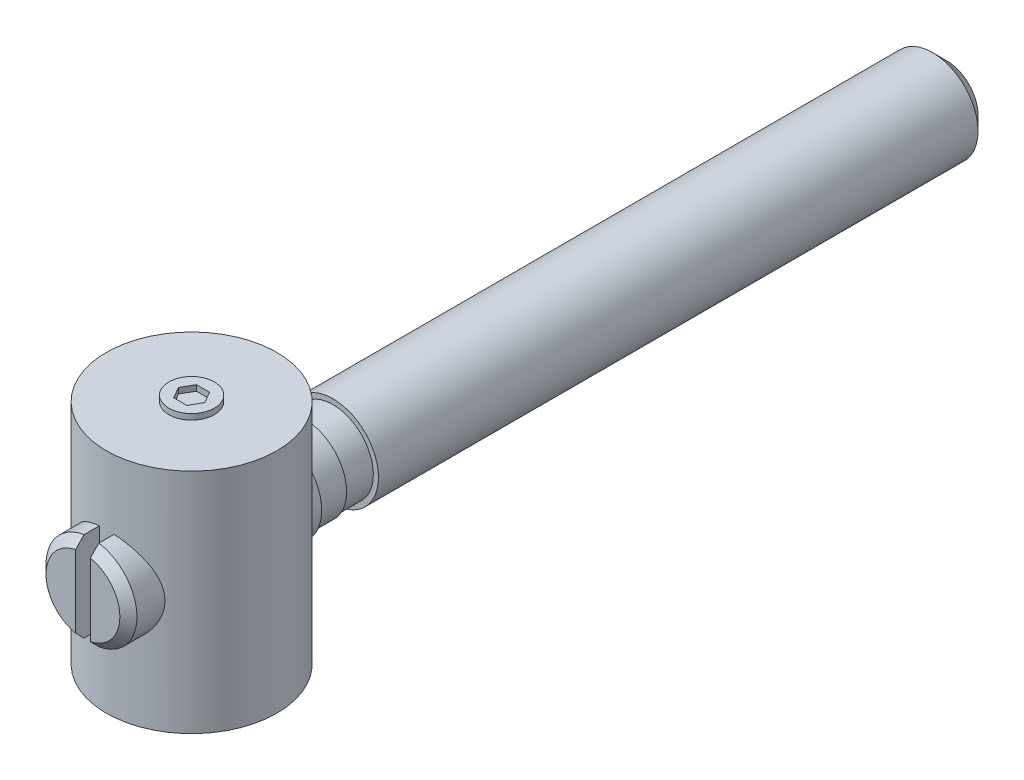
ISO-10303-21;
HEADER;
FILE_DESCRIPTION(('STEP AP214'),'2;1');
FILE_NAME('part.step','',(''),(''),'','','');
FILE_SCHEMA(('AUTOMOTIVE_DESIGN { 1 0 10303 214 1 1 1 1 }'));
ENDSEC;
DATA;
#1=APPLICATION_CONTEXT('core data for automotive mechanical design processes');
#2=APPLICATION_PROTOCOL_DEFINITION('international standard','automotive_design',2000,#1);
#3=PRODUCT_CONTEXT('',#1,'mechanical');
#4=PRODUCT('Part','Part','',(#3));
#5=PRODUCT_RELATED_PRODUCT_CATEGORY('part','',(#4));
#6=PRODUCT_DEFINITION_FORMATION('','',#4);
#7=PRODUCT_DEFINITION_CONTEXT('part definition',#1,'design');
#8=PRODUCT_DEFINITION('design','',#6,#7);
#9=PRODUCT_DEFINITION_SHAPE('','',#8);
#10=(LENGTH_UNIT() NAMED_UNIT(*) SI_UNIT(.MILLI.,.METRE.));
#11=(NAMED_UNIT(*) PLANE_ANGLE_UNIT() SI_UNIT($,.RADIAN.));
#12=(NAMED_UNIT(*) SI_UNIT($,.STERADIAN.) SOLID_ANGLE_UNIT());
#13=UNCERTAINTY_MEASURE_WITH_UNIT(LENGTH_MEASURE(1.E-05),#10,'distance_accuracy_value','');
#14=(GEOMETRIC_REPRESENTATION_CONTEXT(3) GLOBAL_UNCERTAINTY_ASSIGNED_CONTEXT((#13)) GLOBAL_UNIT_ASSIGNED_CONTEXT((#10,
#11,#12)) REPRESENTATION_CONTEXT('',''));
#15=CARTESIAN_POINT('',(0.,0.,0.));
#16=DIRECTION('',(0.,0.,1.));
#17=DIRECTION('',(1.,0.,0.));
#18=AXIS2_PLACEMENT_3D('',#15,#16,#17);
#19=CARTESIAN_POINT('',(0.,0.,9.56172630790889));
#20=DIRECTION('',(0.,0.,-1.));
#21=DIRECTION('',(0.,1.,0.));
#22=AXIS2_PLACEMENT_3D('',#19,#20,#21);
#23=PLANE('',#22);
#24=CARTESIAN_POINT('',(0.,0.,9.56172630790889));
#25=DIRECTION('',(0.,0.,-1.));
#26=DIRECTION('',(0.,1.,0.));
#27=AXIS2_PLACEMENT_3D('',#24,#25,#26);
#28=CIRCLE('',#27,3.25);
#29=CARTESIAN_POINT('',(0.65,-3.18433666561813,9.56172630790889));
#30=VERTEX_POINT('',#29);
#31=CARTESIAN_POINT('',(0.65,3.18433666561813,9.56172630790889));
#32=VERTEX_POINT('',#31);
#33=EDGE_CURVE('E181',#30,#32,#28,.F.);
#34=ORIENTED_EDGE('',*,*,#33,.T.);
#35=DIRECTION('',(0.,1.,0.));
#36=VECTOR('',#35,1.);
#37=CARTESIAN_POINT('',(0.65,3.94683417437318,9.56172630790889));
#38=LINE('',#37,#36);
#39=EDGE_CURVE('E373',#30,#32,#38,.T.);
#40=ORIENTED_EDGE('',*,*,#39,.F.);
#41=EDGE_LOOP('',(#34,#40));
#42=FACE_BOUND('',#41,.T.);
#43=ADVANCED_FACE('F14',(#42),#23,.F.);
#44=CARTESIAN_POINT('',(0.,0.,9.56172630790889));
#45=DIRECTION('',(0.,0.,-1.));
#46=DIRECTION('',(0.,1.,0.));
#47=AXIS2_PLACEMENT_3D('',#44,#45,#46);
#48=CONICAL_SURFACE('',#47,3.25,0.785398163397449);
#49=CARTESIAN_POINT('',(0.65,-8.70456504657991,4.08292612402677));
#50=CARTESIAN_POINT('',(0.650000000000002,-8.39669211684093,4.38993683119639));
#51=CARTESIAN_POINT('',(0.650000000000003,-8.0887810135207,4.69690929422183));
#52=CARTESIAN_POINT('',(0.650000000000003,-7.47282030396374,5.31073608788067));
#53=CARTESIAN_POINT('',(0.650000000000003,-7.16477069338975,5.61759041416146));
#54=CARTESIAN_POINT('',(0.650000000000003,-6.54823771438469,6.23137130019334));
#55=CARTESIAN_POINT('',(0.650000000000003,-6.23975419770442,6.53829771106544));
#56=CARTESIAN_POINT('',(0.650000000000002,-5.62251880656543,7.15186027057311));
#57=CARTESIAN_POINT('',(0.650000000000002,-5.31376694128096,7.45849642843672));
#58=CARTESIAN_POINT('',(0.650000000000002,-4.70842903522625,8.05879904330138));
#59=CARTESIAN_POINT('',(0.650000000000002,-4.41186110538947,8.35248374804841));
#60=CARTESIAN_POINT('',(0.650000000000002,-3.96643026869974,8.79245463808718));
#61=CARTESIAN_POINT('',(0.650000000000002,-3.81784936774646,8.9390262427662));
#62=CARTESIAN_POINT('',(0.650000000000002,-3.52042094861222,9.23189584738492));
#63=CARTESIAN_POINT('',(0.650000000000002,-3.3715734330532,9.37819384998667));
#64=CARTESIAN_POINT('',(0.650000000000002,-3.07356536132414,9.67032043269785));
#65=CARTESIAN_POINT('',(0.650000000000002,-2.92440500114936,9.81614921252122));
#66=CARTESIAN_POINT('',(0.650000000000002,-2.62547929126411,10.1071967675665));
#67=CARTESIAN_POINT('',(0.650000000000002,-2.47571391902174,10.2524155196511));
#68=CARTESIAN_POINT('',(0.650000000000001,-2.17523512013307,10.5418211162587));
#69=CARTESIAN_POINT('',(0.650000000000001,-2.02452186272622,10.6860081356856));
#70=CARTESIAN_POINT('',(0.650000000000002,-1.79709748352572,10.9008470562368));
#71=CARTESIAN_POINT('',(0.650000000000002,-1.72106595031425,10.9722176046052));
#72=CARTESIAN_POINT('',(0.650000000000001,-1.56834745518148,11.1142531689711));
#73=CARTESIAN_POINT('',(0.65,-1.49166050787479,11.1849182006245));
#74=CARTESIAN_POINT('',(0.65,-1.37166741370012,11.2939463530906));
#75=CARTESIAN_POINT('',(0.650000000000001,-1.32870103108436,11.3326831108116));
#76=CARTESIAN_POINT('',(0.650000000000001,-1.24237376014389,11.4097235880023));
#77=CARTESIAN_POINT('',(0.650000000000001,-1.19901283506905,11.4480272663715));
#78=CARTESIAN_POINT('',(0.650000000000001,-1.11149374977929,11.5243047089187));
#79=CARTESIAN_POINT('',(0.650000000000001,-1.0673322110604,11.5622746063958));
#80=CARTESIAN_POINT('',(0.650000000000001,-0.978331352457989,11.6373918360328));
#81=CARTESIAN_POINT('',(0.65,-0.933492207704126,11.6745393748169));
#82=CARTESIAN_POINT('',(0.65,-0.842526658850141,11.7479491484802));
#83=CARTESIAN_POINT('',(0.650000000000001,-0.796393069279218,11.7842025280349));
#84=CARTESIAN_POINT('',(0.650000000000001,-0.702784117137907,11.8549284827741));
#85=CARTESIAN_POINT('',(0.650000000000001,-0.655309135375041,11.8894015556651));
#86=CARTESIAN_POINT('',(0.650000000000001,-0.558661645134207,11.9553647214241));
#87=CARTESIAN_POINT('',(0.650000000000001,-0.509499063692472,11.9868691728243));
#88=CARTESIAN_POINT('',(0.650000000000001,-0.408485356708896,12.0451389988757));
#89=CARTESIAN_POINT('',(0.65,-0.356641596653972,12.0719165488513));
#90=CARTESIAN_POINT('',(0.65,-0.262880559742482,12.1115179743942));
#91=CARTESIAN_POINT('',(0.650000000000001,-0.221756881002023,12.1261577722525));
#92=CARTESIAN_POINT('',(0.650000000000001,-0.137737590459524,12.1485042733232));
#93=CARTESIAN_POINT('',(0.65,-0.0948516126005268,12.1562444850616));
#94=CARTESIAN_POINT('',(0.65,-0.0297912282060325,12.1614144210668));
#95=CARTESIAN_POINT('',(0.650000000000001,-0.00785059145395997,12.162048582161));
#96=CARTESIAN_POINT('',(0.650000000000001,0.035981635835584,12.1610997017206));
#97=CARTESIAN_POINT('',(0.650000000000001,0.0578732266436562,12.1595166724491));
#98=CARTESIAN_POINT('',(0.650000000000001,0.123263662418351,12.1515525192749));
#99=CARTESIAN_POINT('',(0.65,0.16638827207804,12.1419497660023));
#100=CARTESIAN_POINT('',(0.65,0.239287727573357,12.1197137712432));
#101=CARTESIAN_POINT('',(0.650000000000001,0.269558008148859,12.1085697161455));
#102=CARTESIAN_POINT('',(0.650000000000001,0.329032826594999,12.0836907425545));
#103=CARTESIAN_POINT('',(0.650000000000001,0.358236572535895,12.0699539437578));
#104=CARTESIAN_POINT('',(0.650000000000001,0.415789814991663,12.0405159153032));
#105=CARTESIAN_POINT('',(0.650000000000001,0.444134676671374,12.0248057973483));
#106=CARTESIAN_POINT('',(0.650000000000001,0.499980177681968,11.9919879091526));
#107=CARTESIAN_POINT('',(0.65,0.527481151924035,11.9748807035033));
#108=CARTESIAN_POINT('',(0.65,0.58686396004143,11.9363365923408));
#109=CARTESIAN_POINT('',(0.650000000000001,0.618606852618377,11.914687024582));
#110=CARTESIAN_POINT('',(0.650000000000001,0.681342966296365,11.8703234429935));
#111=CARTESIAN_POINT('',(0.650000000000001,0.712336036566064,11.8476092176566));
#112=CARTESIAN_POINT('',(0.65,0.804479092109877,11.778269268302));
#113=CARTESIAN_POINT('',(0.650000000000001,0.864747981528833,11.7304766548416));
#114=CARTESIAN_POINT('',(0.650000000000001,0.983937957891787,11.6329671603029));
#115=CARTESIAN_POINT('',(0.650000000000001,1.04285527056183,11.5832457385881));
#116=CARTESIAN_POINT('',(0.650000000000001,1.1596576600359,11.4826566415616));
#117=CARTESIAN_POINT('',(0.650000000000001,1.21754315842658,11.4317894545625));
#118=CARTESIAN_POINT('',(0.650000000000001,1.33273717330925,11.3291590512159));
#119=CARTESIAN_POINT('',(0.650000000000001,1.39004416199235,11.2773941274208));
#120=CARTESIAN_POINT('',(0.650000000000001,1.50415468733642,11.1733014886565));
#121=CARTESIAN_POINT('',(0.65,1.5609581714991,11.1209737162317));
#122=CARTESIAN_POINT('',(0.65,1.67409623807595,11.0159939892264));
#123=CARTESIAN_POINT('',(0.650000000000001,1.73043142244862,10.9633426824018));
#124=CARTESIAN_POINT('',(0.65,1.84281062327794,10.8577345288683));
#125=CARTESIAN_POINT('',(0.65,1.89885465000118,10.8047776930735));
#126=CARTESIAN_POINT('',(0.65,2.06557383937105,10.6465791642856));
#127=CARTESIAN_POINT('',(0.65,2.17592358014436,10.5409946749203));
#128=CARTESIAN_POINT('',(0.650000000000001,2.39606249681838,10.3292425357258));
#129=CARTESIAN_POINT('',(0.65,2.50585166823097,10.2230748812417));
#130=CARTESIAN_POINT('',(0.65,2.83466232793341,9.90398407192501));
#131=CARTESIAN_POINT('',(0.65,3.05311972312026,9.69047999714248));
#132=CARTESIAN_POINT('',(0.65,3.48939994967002,9.26254806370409));
#133=CARTESIAN_POINT('',(0.65,3.70722228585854,9.04811970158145));
#134=CARTESIAN_POINT('',(0.65,4.14239678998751,8.61879348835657));
#135=CARTESIAN_POINT('',(0.65,4.35974896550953,8.40389564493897));
#136=CARTESIAN_POINT('',(0.65,4.79359052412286,7.97436233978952));
#137=CARTESIAN_POINT('',(0.65,5.01008067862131,7.75972765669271));
#138=CARTESIAN_POINT('',(0.65,5.44286101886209,7.33025496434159));
#139=CARTESIAN_POINT('',(0.649999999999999,5.65915120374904,7.11541695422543));
#140=CARTESIAN_POINT('',(0.65,6.30773962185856,6.47076507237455));
#141=CARTESIAN_POINT('',(0.650000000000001,6.7398288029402,6.04074089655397));
#142=CARTESIAN_POINT('',(0.65,7.29947848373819,5.48337298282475));
#143=CARTESIAN_POINT('',(0.649999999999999,7.42717743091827,5.35616816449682));
#144=CARTESIAN_POINT('',(0.649999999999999,7.68255536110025,5.10173055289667));
#145=CARTESIAN_POINT('',(0.649999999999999,7.81023434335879,4.97449775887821));
#146=CARTESIAN_POINT('',(0.649999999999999,8.06570081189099,4.71988341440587));
#147=CARTESIAN_POINT('',(0.649999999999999,8.19348827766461,4.592501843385));
#148=CARTESIAN_POINT('',(0.649999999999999,8.44904139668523,4.33772478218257));
#149=CARTESIAN_POINT('',(0.649999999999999,8.57680705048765,4.21032929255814));
#150=CARTESIAN_POINT('',(0.65,8.70456504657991,4.08292612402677));
#151=B_SPLINE_CURVE_WITH_KNOTS('',3,(#49,#50,#51,#52,#53,#54,#55,#56,#57,#58,#59,#60,#61,#62,
#63,#64,#65,#66,#67,#68,#69,#70,#71,#72,#73,#74,#75,#76,#77,#78,#79,#80,#81,#82,#83,#84,#85,#86,
#87,#88,#89,#90,#91,#92,#93,#94,#95,#96,#97,#98,#99,#100,#101,#102,#103,#104,#105,#106,#107,
#108,#109,#110,#111,#112,#113,#114,#115,#116,#117,#118,#119,#120,#121,#122,#123,#124,#125,#126,
#127,#128,#129,#130,#131,#132,#133,#134,#135,#136,#137,#138,#139,#140,#141,#142,#143,#144,#145,
#146,#147,#148,#149,#150),.UNSPECIFIED.,.F.,.F.,(4,2,2,2,2,2,2,2,2,2,2,2,2,2,2,2,2,2,2,2,2,2,2,
2,2,2,2,2,2,2,2,2,2,2,2,2,2,2,2,2,2,2,2,2,2,2,2,2,2,2,4),(0.,1.30436648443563,2.60877714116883,
3.91426279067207,5.21970543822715,6.47183438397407,7.09796165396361,7.7240827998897,
8.34988782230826,8.97571636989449,9.60143618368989,9.91427698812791,10.2271108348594,
10.4006593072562,10.5742241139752,10.7489387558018,10.9236089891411,11.0996044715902,
11.2755504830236,11.4505963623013,11.6251845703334,11.755746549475,11.8856709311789,
11.9514152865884,12.0171592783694,12.1489127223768,12.2455611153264,12.3422798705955,
12.4394510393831,12.5365831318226,12.6518208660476,12.7670815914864,12.9977655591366,
13.229030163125,13.4601980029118,13.6918683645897,13.9235626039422,14.1548884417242,
14.3862060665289,14.8443792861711,15.3025561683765,16.2189399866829,17.1359098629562,
18.0528648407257,18.9674270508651,19.8819931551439,21.7108166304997,22.2515501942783,
22.7923005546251,23.3335965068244,23.8748755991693),.UNSPECIFIED.);
#152=CARTESIAN_POINT('',(0.65,-3.94683417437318,8.81172630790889));
#153=VERTEX_POINT('',#152);
#154=EDGE_CURVE('E95',#153,#30,#151,.T.);
#155=ORIENTED_EDGE('',*,*,#154,.F.);
#156=CARTESIAN_POINT('',(0.,0.,8.81172630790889));
#157=DIRECTION('',(0.,0.,-1.));
#158=DIRECTION('',(0.,1.,0.));
#159=AXIS2_PLACEMENT_3D('',#156,#157,#158);
#160=CIRCLE('',#159,4.);
#161=CARTESIAN_POINT('',(0.65,3.94683417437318,8.81172630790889));
#162=VERTEX_POINT('',#161);
#163=EDGE_CURVE('E186',#162,#153,#160,.T.);
#164=ORIENTED_EDGE('',*,*,#163,.F.);
#165=EDGE_CURVE('E195',#32,#162,#151,.T.);
#166=ORIENTED_EDGE('',*,*,#165,.F.);
#167=ORIENTED_EDGE('',*,*,#33,.F.);
#168=EDGE_LOOP('',(#155,#164,#166,#167));
#169=FACE_BOUND('',#168,.T.);
#170=ADVANCED_FACE('F211',(#169),#48,.T.);
#171=CARTESIAN_POINT('',(0.,0.,39.8570922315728));
#172=DIRECTION('',(0.,0.,1.));
#173=DIRECTION('',(0.,-1.,0.));
#174=AXIS2_PLACEMENT_3D('',#171,#172,#173);
#175=CYLINDRICAL_SURFACE('',#174,4.);
#176=CARTESIAN_POINT('',(0.,-4.,7.5));
#177=CARTESIAN_POINT('',(-0.104329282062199,-4.00000040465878,7.5000003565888));
#178=CARTESIAN_POINT('',(-0.20865297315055,-3.9959139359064,7.49781838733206));
#179=CARTESIAN_POINT('',(-0.416519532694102,-3.97962111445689,7.48914792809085));
#180=CARTESIAN_POINT('',(-0.520062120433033,-3.96741197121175,7.48265795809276));
#181=CARTESIAN_POINT('',(-0.725661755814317,-3.93500361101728,7.46552494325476));
#182=CARTESIAN_POINT('',(-0.827717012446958,-3.91479547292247,7.45487726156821));
#183=CARTESIAN_POINT('',(-1.02950974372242,-3.86663812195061,7.429702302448));
#184=CARTESIAN_POINT('',(-1.12924625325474,-3.83868574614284,7.41517343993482));
#185=CARTESIAN_POINT('',(-1.42307484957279,-3.74392721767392,7.36641110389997));
#186=CARTESIAN_POINT('',(-1.61285610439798,-3.66604732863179,7.32690726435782));
#187=CARTESIAN_POINT('',(-1.9762088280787,-3.4836808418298,7.23738512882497));
#188=CARTESIAN_POINT('',(-2.14978022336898,-3.37919412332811,7.18736678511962));
#189=CARTESIAN_POINT('',(-2.48882838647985,-3.13874131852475,7.07739524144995));
#190=CARTESIAN_POINT('',(-2.65301196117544,-3.00115110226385,7.01700391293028));
#191=CARTESIAN_POINT('',(-2.95716832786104,-2.70199516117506,6.89435393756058));
#192=CARTESIAN_POINT('',(-3.09711991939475,-2.54040866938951,6.83209371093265));
#193=CARTESIAN_POINT('',(-3.36178904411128,-2.18006310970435,6.70609881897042));
#194=CARTESIAN_POINT('',(-3.48395288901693,-1.9792578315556,6.64274760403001));
#195=CARTESIAN_POINT('',(-3.64013044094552,-1.66233743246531,6.55766590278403));
#196=CARTESIAN_POINT('',(-3.68768940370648,-1.55404047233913,6.53095573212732));
#197=CARTESIAN_POINT('',(-3.77327802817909,-1.33282028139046,6.48188273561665));
#198=CARTESIAN_POINT('',(-3.8113136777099,-1.21990000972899,6.45951718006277));
#199=CARTESIAN_POINT('',(-3.87528400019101,-0.997366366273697,6.42132989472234));
#200=CARTESIAN_POINT('',(-3.90182208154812,-0.887981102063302,6.40518874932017));
#201=CARTESIAN_POINT('',(-3.94564516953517,-0.666772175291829,6.37828721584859));
#202=CARTESIAN_POINT('',(-3.9629354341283,-0.554949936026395,6.36752377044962));
#203=CARTESIAN_POINT('',(-3.9879763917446,-0.329923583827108,6.35187091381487));
#204=CARTESIAN_POINT('',(-3.99573492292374,-0.21672068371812,6.3469766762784));
#205=CARTESIAN_POINT('',(-4.00159448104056,0.0100266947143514,6.34328425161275));
#206=CARTESIAN_POINT('',(-3.99969667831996,0.123571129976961,6.34448532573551));
#207=CARTESIAN_POINT('',(-3.98722972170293,0.333880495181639,6.35232566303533));
#208=CARTESIAN_POINT('',(-3.97792191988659,0.430752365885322,6.35817365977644));
#209=CARTESIAN_POINT('',(-3.95234427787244,0.62322962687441,6.37410335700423));
#210=CARTESIAN_POINT('',(-3.93607229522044,0.718834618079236,6.38418636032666));
#211=CARTESIAN_POINT('',(-3.87707963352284,1.00276725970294,6.42031483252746));
#212=CARTESIAN_POINT('',(-3.82417439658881,1.18833960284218,6.45224517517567));
#213=CARTESIAN_POINT('',(-3.69194831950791,1.55171916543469,6.52881406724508));
#214=CARTESIAN_POINT('',(-3.61206074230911,1.72925828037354,6.57372199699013));
#215=CARTESIAN_POINT('',(-3.42858159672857,2.06934086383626,6.67125272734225));
#216=CARTESIAN_POINT('',(-3.32497952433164,2.23187764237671,6.72387894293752));
#217=CARTESIAN_POINT('',(-3.07935066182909,2.56242703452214,6.84022433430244));
#218=CARTESIAN_POINT('',(-2.93391468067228,2.72773501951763,6.90443725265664));
#219=CARTESIAN_POINT('',(-2.6172236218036,3.03289545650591,7.03058565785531));
#220=CARTESIAN_POINT('',(-2.44595290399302,3.17273237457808,7.09251973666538));
#221=CARTESIAN_POINT('',(-2.16676749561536,3.36435932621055,7.18091003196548));
#222=CARTESIAN_POINT('',(-2.06686725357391,3.42666004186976,7.21036936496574));
#223=CARTESIAN_POINT('',(-1.86130318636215,3.54252047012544,7.26614530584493));
#224=CARTESIAN_POINT('',(-1.75564184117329,3.59608390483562,7.29246325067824));
#225=CARTESIAN_POINT('',(-1.53927716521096,3.69387554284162,7.34117979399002));
#226=CARTESIAN_POINT('',(-1.42857623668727,3.73810813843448,7.36358023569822));
#227=CARTESIAN_POINT('',(-1.20291776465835,3.81670749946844,7.40379052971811));
#228=CARTESIAN_POINT('',(-1.08796078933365,3.85107557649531,7.42160099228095));
#229=CARTESIAN_POINT('',(-0.865261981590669,3.90682600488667,7.45068973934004));
#230=CARTESIAN_POINT('',(-0.757800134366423,3.92909777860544,7.46241120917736));
#231=CARTESIAN_POINT('',(-0.541018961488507,3.96476496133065,7.48125196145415));
#232=CARTESIAN_POINT('',(-0.431699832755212,3.97816130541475,7.48837172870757));
#233=CARTESIAN_POINT('',(-0.212172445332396,3.99588587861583,7.49780284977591));
#234=CARTESIAN_POINT('',(-0.101964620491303,4.00021829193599,7.50011642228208));
#235=CARTESIAN_POINT('',(0.118422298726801,3.99976477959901,7.4998745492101));
#236=CARTESIAN_POINT('',(0.228601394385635,3.99497937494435,7.49731938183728));
#237=CARTESIAN_POINT('',(0.437982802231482,3.97720766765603,7.48786549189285));
#238=CARTESIAN_POINT('',(0.537271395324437,3.96500748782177,7.48138330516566));
#239=CARTESIAN_POINT('',(0.734354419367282,3.93328142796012,7.46461842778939));
#240=CARTESIAN_POINT('',(0.832148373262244,3.9137532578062,7.4543345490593));
#241=CARTESIAN_POINT('',(1.12223852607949,3.84447795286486,7.41811350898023));
#242=CARTESIAN_POINT('',(1.31143028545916,3.78402368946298,7.38679785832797));
#243=CARTESIAN_POINT('',(1.68128124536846,3.63512086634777,7.31162738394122));
#244=CARTESIAN_POINT('',(1.86161005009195,3.54601184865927,7.26747936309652));
#245=CARTESIAN_POINT('',(2.20530240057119,3.34312620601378,7.1706722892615));
#246=CARTESIAN_POINT('',(2.36865928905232,3.22933995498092,7.11800991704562));
#247=CARTESIAN_POINT('',(2.69245168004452,2.96627213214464,7.00238186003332));
#248=CARTESIAN_POINT('',(2.85067860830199,2.81448780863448,6.93891733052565));
#249=CARTESIAN_POINT('',(3.14054502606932,2.48694968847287,6.8126367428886));
#250=CARTESIAN_POINT('',(3.27215988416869,2.31117393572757,6.74982133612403));
#251=CARTESIAN_POINT('',(3.51371844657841,1.92581246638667,6.62747054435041));
#252=CARTESIAN_POINT('',(3.62160676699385,1.71474727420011,6.56844065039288));
#253=CARTESIAN_POINT('',(3.75479280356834,1.38408550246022,6.49262165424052));
#254=CARTESIAN_POINT('',(3.79441212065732,1.2715285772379,6.46947070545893));
#255=CARTESIAN_POINT('',(3.86363310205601,1.04241683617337,6.42837188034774));
#256=CARTESIAN_POINT('',(3.89323655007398,0.925862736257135,6.41042307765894));
#257=CARTESIAN_POINT('',(3.93952982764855,0.701376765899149,6.38206607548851));
#258=CARTESIAN_POINT('',(3.9571999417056,0.593717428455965,6.37109180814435));
#259=CARTESIAN_POINT('',(3.98369950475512,0.376909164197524,6.35455615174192));
#260=CARTESIAN_POINT('',(3.99253018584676,0.267760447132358,6.34899400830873));
#261=CARTESIAN_POINT('',(4.00119558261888,0.0490176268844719,6.343537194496));
#262=CARTESIAN_POINT('',(4.00103521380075,-0.0605762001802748,6.34363942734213));
#263=CARTESIAN_POINT('',(3.99174615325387,-0.279197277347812,6.34948650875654));
#264=CARTESIAN_POINT('',(3.98261805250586,-0.388224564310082,6.3552309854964));
#265=CARTESIAN_POINT('',(3.94527417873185,-0.68659497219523,6.37853289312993));
#266=CARTESIAN_POINT('',(3.90785104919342,-0.874437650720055,6.40173425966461));
#267=CARTESIAN_POINT('',(3.80746909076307,-1.24070660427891,6.46192910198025));
#268=CARTESIAN_POINT('',(3.74450079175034,-1.41912935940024,6.49892769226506));
#269=CARTESIAN_POINT('',(3.59040170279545,-1.77451283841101,6.58538478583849));
#270=CARTESIAN_POINT('',(3.4977179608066,-1.950638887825,6.63549242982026));
#271=CARTESIAN_POINT('',(3.28835420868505,-2.28601363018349,6.74169802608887));
#272=CARTESIAN_POINT('',(3.17166127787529,-2.44525316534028,6.7977991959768));
#273=CARTESIAN_POINT('',(2.8979268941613,-2.76636004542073,6.91936180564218));
#274=CARTESIAN_POINT('',(2.73749066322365,-2.92527561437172,6.98500336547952));
#275=CARTESIAN_POINT('',(2.39071522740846,-3.21487945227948,7.11114874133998));
#276=CARTESIAN_POINT('',(2.20435938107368,-3.34554944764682,7.17164921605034));
#277=CARTESIAN_POINT('',(1.90608771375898,-3.51859665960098,7.2545091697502));
#278=CARTESIAN_POINT('',(1.80214051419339,-3.57297318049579,7.2810899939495));
#279=CARTESIAN_POINT('',(1.58915491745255,-3.67265414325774,7.33051892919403));
#280=CARTESIAN_POINT('',(1.48011905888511,-3.71796305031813,7.35336887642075));
#281=CARTESIAN_POINT('',(1.2579483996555,-3.79888380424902,7.39461358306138));
#282=CARTESIAN_POINT('',(1.14482237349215,-3.83451515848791,7.4130172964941));
#283=CARTESIAN_POINT('',(0.915246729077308,-3.89569281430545,7.44484645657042));
#284=CARTESIAN_POINT('',(0.798798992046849,-3.92124470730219,7.45827466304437));
#285=CARTESIAN_POINT('',(0.569078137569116,-3.96094679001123,7.47922653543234));
#286=CARTESIAN_POINT('',(0.455909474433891,-3.97557224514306,7.48699590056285));
#287=CARTESIAN_POINT('',(0.228491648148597,-3.99509868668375,7.49738246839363));
#288=CARTESIAN_POINT('',(0.114242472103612,-3.99999955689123,7.49999960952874));
#289=CARTESIAN_POINT('',(0.,-4.,7.5));
#290=B_SPLINE_CURVE_WITH_KNOTS('',3,(#176,#177,#178,#179,#180,#181,#182,#183,#184,#185,#186,
#187,#188,#189,#190,#191,#192,#193,#194,#195,#196,#197,#198,#199,#200,#201,#202,#203,#204,#205,
#206,#207,#208,#209,#210,#211,#212,#213,#214,#215,#216,#217,#218,#219,#220,#221,#222,#223,#224,
#225,#226,#227,#228,#229,#230,#231,#232,#233,#234,#235,#236,#237,#238,#239,#240,#241,#242,#243,
#244,#245,#246,#247,#248,#249,#250,#251,#252,#253,#254,#255,#256,#257,#258,#259,#260,#261,#262,
#263,#264,#265,#266,#267,#268,#269,#270,#271,#272,#273,#274,#275,#276,#277,#278,#279,#280,#281,
#282,#283,#284,#285,#286,#287,#288,#289),.UNSPECIFIED.,.T.,.F.,(4,2,2,2,2,2,2,2,2,2,2,2,2,2,2,2,
2,2,2,2,2,2,2,2,2,2,2,2,2,2,2,2,2,2,2,2,2,2,2,2,2,2,2,2,2,2,2,2,2,2,2,2,2,2,2,2,4),(0.,
0.312875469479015,0.625858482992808,0.939191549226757,1.25265277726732,1.87635275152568,
2.50005555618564,3.16498046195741,3.83048419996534,4.55668682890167,4.92002643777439,
5.28313701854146,5.6237663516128,5.96420180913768,6.30435713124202,6.64447122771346,
6.93659372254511,7.22880615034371,7.81285364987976,8.41002203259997,9.0074554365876,
9.69267368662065,10.3783084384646,10.7419894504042,11.1055151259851,11.4688692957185,
11.832175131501,12.1628321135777,12.4934542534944,12.8239237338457,13.1543743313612,
13.4547461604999,13.7552119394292,14.3555858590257,14.9709302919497,15.5865151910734,
16.2683843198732,16.9508817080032,17.6793249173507,18.0434998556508,18.407609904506,
18.736085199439,19.0645147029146,19.3927646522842,19.720992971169,20.2969971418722,
20.8732150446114,21.4865540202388,22.1002239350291,22.8026614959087,23.5055521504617,
23.8659835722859,24.2262370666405,24.5857589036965,24.9450810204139,25.2876812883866,
25.6302856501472),.UNSPECIFIED.);
#291=CARTESIAN_POINT('',(0.65,3.94683417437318,7.47178024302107));
#292=VERTEX_POINT('',#291);
#293=CARTESIAN_POINT('',(0.65,-3.94683417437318,7.47178024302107));
#294=VERTEX_POINT('',#293);
#295=EDGE_CURVE('E398',#292,#294,#290,.T.);
#296=ORIENTED_EDGE('',*,*,#295,.F.);
#297=DIRECTION('',(0.,0.,1.));
#298=VECTOR('',#297,1.);
#299=CARTESIAN_POINT('',(0.65,3.94683417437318,7.06172630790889));
#300=LINE('',#299,#298);
#301=EDGE_CURVE('E387',#292,#162,#300,.T.);
#302=ORIENTED_EDGE('',*,*,#301,.T.);
#303=ORIENTED_EDGE('',*,*,#163,.T.);
#304=DIRECTION('',(0.,0.,1.));
#305=VECTOR('',#304,1.);
#306=CARTESIAN_POINT('',(0.65,-3.94683417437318,7.06172630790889));
#307=LINE('',#306,#305);
#308=EDGE_CURVE('E379',#294,#153,#307,.T.);
#309=ORIENTED_EDGE('',*,*,#308,.F.);
#310=EDGE_LOOP('',(#296,#302,#303,#309));
#311=FACE_BOUND('',#310,.T.);
#312=ADVANCED_FACE('F220',(#311),#175,.T.);
#313=CARTESIAN_POINT('',(0.65,3.94683417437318,7.06172630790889));
#314=DIRECTION('',(1.,0.,0.));
#315=DIRECTION('',(0.,1.,0.));
#316=AXIS2_PLACEMENT_3D('',#313,#314,#315);
#317=PLANE('',#316);
#318=DIRECTION('',(0.,1.,0.));
#319=VECTOR('',#318,1.);
#320=CARTESIAN_POINT('',(0.65,-10.,7.47178024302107));
#321=LINE('',#320,#319);
#322=EDGE_CURVE('E390',#294,#292,#321,.T.);
#323=ORIENTED_EDGE('',*,*,#322,.F.);
#324=ORIENTED_EDGE('',*,*,#308,.T.);
#325=ORIENTED_EDGE('',*,*,#154,.T.);
#326=ORIENTED_EDGE('',*,*,#39,.T.);
#327=ORIENTED_EDGE('',*,*,#165,.T.);
#328=ORIENTED_EDGE('',*,*,#301,.F.);
#329=EDGE_LOOP('',(#323,#324,#325,#326,#327,#328));
#330=FACE_BOUND('',#329,.T.);
#331=ADVANCED_FACE('F215',(#330),#317,.F.);
#332=CARTESIAN_POINT('',(0.,10.,0.));
#333=DIRECTION('',(0.,1.,0.));
#334=DIRECTION('',(-1.,0.,0.));
#335=AXIS2_PLACEMENT_3D('',#332,#333,#334);
#336=PLANE('',#335);
#337=DIRECTION('',(-1.,0.,0.));
#338=VECTOR('',#337,1.);
#339=CARTESIAN_POINT('',(-0.57735026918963,10.,1.));
#340=LINE('',#339,#338);
#341=CARTESIAN_POINT('',(0.577350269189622,10.,1.));
#342=VERTEX_POINT('',#341);
#343=CARTESIAN_POINT('',(-0.57735026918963,10.,1.));
#344=VERTEX_POINT('',#343);
#345=EDGE_CURVE('E413',#342,#344,#340,.T.);
#346=ORIENTED_EDGE('',*,*,#345,.F.);
#347=DIRECTION('',(-0.5,0.,0.866025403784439));
#348=VECTOR('',#347,1.);
#349=CARTESIAN_POINT('',(0.577350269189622,10.,1.));
#350=LINE('',#349,#348);
#351=CARTESIAN_POINT('',(1.15470053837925,10.,0.));
#352=VERTEX_POINT('',#351);
#353=EDGE_CURVE('E410',#352,#342,#350,.T.);
#354=ORIENTED_EDGE('',*,*,#353,.F.);
#355=DIRECTION('',(0.5,0.,0.866025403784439));
#356=VECTOR('',#355,1.);
#357=CARTESIAN_POINT('',(1.15470053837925,10.,0.));
#358=LINE('',#357,#356);
#359=CARTESIAN_POINT('',(0.577350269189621,10.,-1.));
#360=VERTEX_POINT('',#359);
#361=EDGE_CURVE('E339',#360,#352,#358,.T.);
#362=ORIENTED_EDGE('',*,*,#361,.F.);
#363=DIRECTION('',(1.,0.,0.));
#364=VECTOR('',#363,1.);
#365=CARTESIAN_POINT('',(0.577350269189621,10.,-1.));
#366=LINE('',#365,#364);
#367=CARTESIAN_POINT('',(-0.57735026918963,10.,-1.));
#368=VERTEX_POINT('',#367);
#369=EDGE_CURVE('E407',#368,#360,#366,.T.);
#370=ORIENTED_EDGE('',*,*,#369,.F.);
#371=DIRECTION('',(0.5,0.,-0.866025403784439));
#372=VECTOR('',#371,1.);
#373=CARTESIAN_POINT('',(-0.57735026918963,10.,-1.));
#374=LINE('',#373,#372);
#375=CARTESIAN_POINT('',(-1.15470053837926,10.,0.));
#376=VERTEX_POINT('',#375);
#377=EDGE_CURVE('E86',#376,#368,#374,.T.);
#378=ORIENTED_EDGE('',*,*,#377,.F.);
#379=DIRECTION('',(-0.5,0.,-0.866025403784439));
#380=VECTOR('',#379,1.);
#381=CARTESIAN_POINT('',(-1.15470053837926,10.,0.));
#382=LINE('',#381,#380);
#383=EDGE_CURVE('E404',#344,#376,#382,.T.);
#384=ORIENTED_EDGE('',*,*,#383,.F.);
#385=EDGE_LOOP('',(#346,#354,#362,#370,#378,#384));
#386=FACE_BOUND('',#385,.T.);
#387=ADVANCED_FACE('F219',(#386),#336,.T.);
#388=CARTESIAN_POINT('',(-0.57735026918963,9.,1.));
#389=DIRECTION('',(0.,0.,1.));
#390=DIRECTION('',(1.,0.,0.));
#391=AXIS2_PLACEMENT_3D('',#388,#389,#390);
#392=PLANE('',#391);
#393=DIRECTION('',(0.,1.,0.));
#394=VECTOR('',#393,1.);
#395=CARTESIAN_POINT('',(0.577350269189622,9.,1.));
#396=LINE('',#395,#394);
#397=CARTESIAN_POINT('',(0.577350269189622,10.5,1.));
#398=VERTEX_POINT('',#397);
#399=EDGE_CURVE('E349',#342,#398,#396,.T.);
#400=ORIENTED_EDGE('',*,*,#399,.F.);
#401=ORIENTED_EDGE('',*,*,#345,.T.);
#402=DIRECTION('',(0.,1.,0.));
#403=VECTOR('',#402,1.);
#404=CARTESIAN_POINT('',(-0.57735026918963,9.,1.));
#405=LINE('',#404,#403);
#406=CARTESIAN_POINT('',(-0.57735026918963,10.5,1.));
#407=VERTEX_POINT('',#406);
#408=EDGE_CURVE('E80',#344,#407,#405,.T.);
#409=ORIENTED_EDGE('',*,*,#408,.T.);
#410=DIRECTION('',(1.,0.,0.));
#411=VECTOR('',#410,1.);
#412=CARTESIAN_POINT('',(-0.57735026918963,10.5,1.));
#413=LINE('',#412,#411);
#414=EDGE_CURVE('E362',#407,#398,#413,.T.);
#415=ORIENTED_EDGE('',*,*,#414,.T.);
#416=EDGE_LOOP('',(#400,#401,#409,#415));
#417=FACE_BOUND('',#416,.T.);
#418=ADVANCED_FACE('F300',(#417),#392,.F.);
#419=CARTESIAN_POINT('',(0.577350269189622,9.,1.));
#420=DIRECTION('',(0.866025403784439,0.,0.5));
#421=DIRECTION('',(0.5,0.,-0.866025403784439));
#422=AXIS2_PLACEMENT_3D('',#419,#420,#421);
#423=PLANE('',#422);
#424=DIRECTION('',(0.,1.,0.));
#425=VECTOR('',#424,1.);
#426=CARTESIAN_POINT('',(1.15470053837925,9.,0.));
#427=LINE('',#426,#425);
#428=CARTESIAN_POINT('',(1.15470053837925,10.5,0.));
#429=VERTEX_POINT('',#428);
#430=EDGE_CURVE('E346',#352,#429,#427,.T.);
#431=ORIENTED_EDGE('',*,*,#430,.F.);
#432=ORIENTED_EDGE('',*,*,#353,.T.);
#433=ORIENTED_EDGE('',*,*,#399,.T.);
#434=DIRECTION('',(0.5,0.,-0.866025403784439));
#435=VECTOR('',#434,1.);
#436=CARTESIAN_POINT('',(0.577350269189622,10.5,1.));
#437=LINE('',#436,#435);
#438=EDGE_CURVE('E359',#398,#429,#437,.T.);
#439=ORIENTED_EDGE('',*,*,#438,.T.);
#440=EDGE_LOOP('',(#431,#432,#433,#439));
#441=FACE_BOUND('',#440,.T.);
#442=ADVANCED_FACE('F306',(#441),#423,.F.);
#443=CARTESIAN_POINT('',(1.15470053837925,9.,0.));
#444=DIRECTION('',(0.866025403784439,0.,-0.5));
#445=DIRECTION('',(-0.5,0.,-0.866025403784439));
#446=AXIS2_PLACEMENT_3D('',#443,#444,#445);
#447=PLANE('',#446);
#448=DIRECTION('',(0.,1.,0.));
#449=VECTOR('',#448,1.);
#450=CARTESIAN_POINT('',(0.577350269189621,9.,-1.));
#451=LINE('',#450,#449);
#452=CARTESIAN_POINT('',(0.577350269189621,10.5,-1.));
#453=VERTEX_POINT('',#452);
#454=EDGE_CURVE('E338',#360,#453,#451,.T.);
#455=ORIENTED_EDGE('',*,*,#454,.F.);
#456=ORIENTED_EDGE('',*,*,#361,.T.);
#457=ORIENTED_EDGE('',*,*,#430,.T.);
#458=DIRECTION('',(-0.5,0.,-0.866025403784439));
#459=VECTOR('',#458,1.);
#460=CARTESIAN_POINT('',(1.15470053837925,10.5,0.));
#461=LINE('',#460,#459);
#462=EDGE_CURVE('E342',#429,#453,#461,.T.);
#463=ORIENTED_EDGE('',*,*,#462,.T.);
#464=EDGE_LOOP('',(#455,#456,#457,#463));
#465=FACE_BOUND('',#464,.T.);
#466=ADVANCED_FACE('F326',(#465),#447,.F.);
#467=CARTESIAN_POINT('',(0.577350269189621,9.,-1.));
#468=DIRECTION('',(0.,0.,-1.));
#469=DIRECTION('',(-1.,0.,0.));
#470=AXIS2_PLACEMENT_3D('',#467,#468,#469);
#471=PLANE('',#470);
#472=DIRECTION('',(0.,1.,0.));
#473=VECTOR('',#472,1.);
#474=CARTESIAN_POINT('',(-0.57735026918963,9.,-1.));
#475=LINE('',#474,#473);
#476=CARTESIAN_POINT('',(-0.57735026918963,10.5,-1.));
#477=VERTEX_POINT('',#476);
#478=EDGE_CURVE('E347',#368,#477,#475,.T.);
#479=ORIENTED_EDGE('',*,*,#478,.F.);
#480=ORIENTED_EDGE('',*,*,#369,.T.);
#481=ORIENTED_EDGE('',*,*,#454,.T.);
#482=DIRECTION('',(-1.,0.,0.));
#483=VECTOR('',#482,1.);
#484=CARTESIAN_POINT('',(0.577350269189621,10.5,-1.));
#485=LINE('',#484,#483);
#486=EDGE_CURVE('E355',#453,#477,#485,.T.);
#487=ORIENTED_EDGE('',*,*,#486,.T.);
#488=EDGE_LOOP('',(#479,#480,#481,#487));
#489=FACE_BOUND('',#488,.T.);
#490=ADVANCED_FACE('F253',(#489),#471,.F.);
#491=CARTESIAN_POINT('',(-0.57735026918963,9.,-1.));
#492=DIRECTION('',(-0.866025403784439,0.,-0.5));
#493=DIRECTION('',(-0.5,0.,0.866025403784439));
#494=AXIS2_PLACEMENT_3D('',#491,#492,#493);
#495=PLANE('',#494);
#496=DIRECTION('',(0.,1.,0.));
#497=VECTOR('',#496,1.);
#498=CARTESIAN_POINT('',(-1.15470053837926,9.,0.));
#499=LINE('',#498,#497);
#500=CARTESIAN_POINT('',(-1.15470053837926,10.5,0.));
#501=VERTEX_POINT('',#500);
#502=EDGE_CURVE('E357',#376,#501,#499,.T.);
#503=ORIENTED_EDGE('',*,*,#502,.F.);
#504=ORIENTED_EDGE('',*,*,#377,.T.);
#505=ORIENTED_EDGE('',*,*,#478,.T.);
#506=DIRECTION('',(-0.5,0.,0.866025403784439));
#507=VECTOR('',#506,1.);
#508=CARTESIAN_POINT('',(-0.57735026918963,10.5,-1.));
#509=LINE('',#508,#507);
#510=EDGE_CURVE('E366',#477,#501,#509,.T.);
#511=ORIENTED_EDGE('',*,*,#510,.T.);
#512=EDGE_LOOP('',(#503,#504,#505,#511));
#513=FACE_BOUND('',#512,.T.);
#514=ADVANCED_FACE('F318',(#513),#495,.F.);
#515=CARTESIAN_POINT('',(-1.15470053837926,9.,0.));
#516=DIRECTION('',(-0.866025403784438,0.,0.5));
#517=DIRECTION('',(0.5,0.,0.866025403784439));
#518=AXIS2_PLACEMENT_3D('',#515,#516,#517);
#519=PLANE('',#518);
#520=ORIENTED_EDGE('',*,*,#408,.F.);
#521=ORIENTED_EDGE('',*,*,#383,.T.);
#522=ORIENTED_EDGE('',*,*,#502,.T.);
#523=DIRECTION('',(0.5,0.,0.866025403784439));
#524=VECTOR('',#523,1.);
#525=CARTESIAN_POINT('',(-1.15470053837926,10.5,0.));
#526=LINE('',#525,#524);
#527=EDGE_CURVE('E364',#501,#407,#526,.T.);
#528=ORIENTED_EDGE('',*,*,#527,.T.);
#529=EDGE_LOOP('',(#520,#521,#522,#528));
#530=FACE_BOUND('',#529,.T.);
#531=ADVANCED_FACE('F316',(#530),#519,.F.);
#532=CARTESIAN_POINT('',(0.,10.5,0.));
#533=DIRECTION('',(0.,-1.,0.));
#534=DIRECTION('',(1.,0.,0.));
#535=AXIS2_PLACEMENT_3D('',#532,#533,#534);
#536=PLANE('',#535);
#537=ORIENTED_EDGE('',*,*,#527,.F.);
#538=ORIENTED_EDGE('',*,*,#510,.F.);
#539=ORIENTED_EDGE('',*,*,#486,.F.);
#540=ORIENTED_EDGE('',*,*,#462,.F.);
#541=ORIENTED_EDGE('',*,*,#438,.F.);
#542=ORIENTED_EDGE('',*,*,#414,.F.);
#543=EDGE_LOOP('',(#537,#538,#539,#540,#541,#542));
#544=FACE_BOUND('',#543,.T.);
#545=CARTESIAN_POINT('',(0.,10.5,0.));
#546=DIRECTION('',(0.,-1.,0.));
#547=DIRECTION('',(1.,0.,0.));
#548=AXIS2_PLACEMENT_3D('',#545,#546,#547);
#549=CIRCLE('',#548,2.);
#550=CARTESIAN_POINT('',(2.,10.5,0.));
#551=VERTEX_POINT('',#550);
#552=EDGE_CURVE('E351',#551,#551,#549,.T.);
#553=ORIENTED_EDGE('',*,*,#552,.F.);
#554=EDGE_LOOP('',(#553));
#555=FACE_BOUND('',#554,.T.);
#556=ADVANCED_FACE('F312',(#544,#555),#536,.F.);
#557=CARTESIAN_POINT('',(0.,6.5,0.));
#558=DIRECTION('',(0.,-1.,0.));
#559=DIRECTION('',(1.,0.,0.));
#560=AXIS2_PLACEMENT_3D('',#557,#558,#559);
#561=CYLINDRICAL_SURFACE('',#560,2.);
#562=ORIENTED_EDGE('',*,*,#552,.T.);
#563=EDGE_LOOP('',(#562));
#564=FACE_BOUND('',#563,.T.);
#565=CARTESIAN_POINT('',(0.,10.,0.));
#566=DIRECTION('',(0.,-1.,0.));
#567=DIRECTION('',(1.,0.,0.));
#568=AXIS2_PLACEMENT_3D('',#565,#566,#567);
#569=CIRCLE('',#568,2.);
#570=CARTESIAN_POINT('',(2.,10.,0.));
#571=VERTEX_POINT('',#570);
#572=EDGE_CURVE('E415',#571,#571,#569,.T.);
#573=ORIENTED_EDGE('',*,*,#572,.F.);
#574=EDGE_LOOP('',(#573));
#575=FACE_BOUND('',#574,.T.);
#576=ADVANCED_FACE('F309',(#564,#575),#561,.T.);
#577=CARTESIAN_POINT('',(0.,-10.,0.));
#578=DIRECTION('',(0.,-1.,0.));
#579=DIRECTION('',(1.,0.,0.));
#580=AXIS2_PLACEMENT_3D('',#577,#578,#579);
#581=PLANE('',#580);
#582=CARTESIAN_POINT('',(0.,-10.,0.));
#583=DIRECTION('',(0.,-1.,0.));
#584=DIRECTION('',(1.,0.,0.));
#585=AXIS2_PLACEMENT_3D('',#582,#583,#584);
#586=CIRCLE('',#585,7.5);
#587=CARTESIAN_POINT('',(7.5,-10.,0.));
#588=VERTEX_POINT('',#587);
#589=EDGE_CURVE('E369',#588,#588,#586,.T.);
#590=ORIENTED_EDGE('',*,*,#589,.T.);
#591=EDGE_LOOP('',(#590));
#592=FACE_BOUND('',#591,.T.);
#593=ADVANCED_FACE('F255',(#592),#581,.T.);
#594=CARTESIAN_POINT('',(0.,10.,0.));
#595=DIRECTION('',(0.,-1.,0.));
#596=DIRECTION('',(1.,0.,0.));
#597=AXIS2_PLACEMENT_3D('',#594,#595,#596);
#598=PLANE('',#597);
#599=CARTESIAN_POINT('',(0.,10.,0.));
#600=DIRECTION('',(0.,-1.,0.));
#601=DIRECTION('',(1.,0.,0.));
#602=AXIS2_PLACEMENT_3D('',#599,#600,#601);
#603=CIRCLE('',#602,7.5);
#604=CARTESIAN_POINT('',(7.5,10.,0.));
#605=VERTEX_POINT('',#604);
#606=EDGE_CURVE('E371',#605,#605,#603,.T.);
#607=ORIENTED_EDGE('',*,*,#606,.F.);
#608=EDGE_LOOP('',(#607));
#609=FACE_BOUND('',#608,.T.);
#610=ORIENTED_EDGE('',*,*,#572,.T.);
#611=EDGE_LOOP('',(#610));
#612=FACE_BOUND('',#611,.T.);
#613=ADVANCED_FACE('F16',(#609,#612),#598,.F.);
#614=CARTESIAN_POINT('',(0.,-10.,0.));
#615=DIRECTION('',(0.,1.,0.));
#616=DIRECTION('',(-1.,0.,0.));
#617=AXIS2_PLACEMENT_3D('',#614,#615,#616);
#618=CYLINDRICAL_SURFACE('',#617,7.5);
#619=DIRECTION('',(0.,1.,0.));
#620=VECTOR('',#619,1.);
#621=CARTESIAN_POINT('',(-0.65,-10.,7.47178024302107));
#622=LINE('',#621,#620);
#623=CARTESIAN_POINT('',(-0.65,3.94683417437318,7.47178024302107));
#624=VERTEX_POINT('',#623);
#625=CARTESIAN_POINT('',(-0.65,-3.94683417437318,7.47178024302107));
#626=VERTEX_POINT('',#625);
#627=EDGE_CURVE('E248',#624,#626,#622,.F.);
#628=ORIENTED_EDGE('',*,*,#627,.T.);
#629=EDGE_CURVE('E237',#626,#624,#290,.T.);
#630=ORIENTED_EDGE('',*,*,#629,.T.);
#631=EDGE_LOOP('',(#628,#630));
#632=FACE_BOUND('',#631,.T.);
#633=ORIENTED_EDGE('',*,*,#606,.T.);
#634=EDGE_LOOP('',(#633));
#635=FACE_BOUND('',#634,.T.);
#636=ORIENTED_EDGE('',*,*,#589,.F.);
#637=EDGE_LOOP('',(#636));
#638=FACE_BOUND('',#637,.T.);
#639=ORIENTED_EDGE('',*,*,#322,.T.);
#640=ORIENTED_EDGE('',*,*,#295,.T.);
#641=EDGE_LOOP('',(#639,#640));
#642=FACE_BOUND('',#641,.T.);
#643=DIRECTION('',(0.,1.,0.));
#644=VECTOR('',#643,1.);
#645=CARTESIAN_POINT('',(-0.960252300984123,-10.,-7.43827369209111));
#646=LINE('',#645,#644);
#647=CARTESIAN_POINT('',(-0.960252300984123,3.57322200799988,-7.43827369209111));
#648=VERTEX_POINT('',#647);
#649=CARTESIAN_POINT('',(-0.960252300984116,3.88302916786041,-7.43827369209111));
#650=VERTEX_POINT('',#649);
#651=EDGE_CURVE('E643',#648,#650,#646,.T.);
#652=ORIENTED_EDGE('',*,*,#651,.T.);
#653=CARTESIAN_POINT('',(-0.960252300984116,3.88302916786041,-7.43827369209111));
#654=CARTESIAN_POINT('',(-1.06900892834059,3.85614789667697,-7.42425153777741));
#655=CARTESIAN_POINT('',(-1.17631869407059,3.82474958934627,-7.40795601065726));
#656=CARTESIAN_POINT('',(-1.38726038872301,3.7533809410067,-7.3713559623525));
#657=CARTESIAN_POINT('',(-1.49089491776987,3.71341680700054,-7.35105434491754));
#658=CARTESIAN_POINT('',(-1.69339737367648,3.62553971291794,-7.3070588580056));
#659=CARTESIAN_POINT('',(-1.79228491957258,3.57766391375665,-7.28338091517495));
#660=CARTESIAN_POINT('',(-1.98523069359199,3.47431281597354,-7.23317431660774));
#661=CARTESIAN_POINT('',(-2.07928809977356,3.41883622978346,-7.20664517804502));
#662=CARTESIAN_POINT('',(-2.35298803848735,3.24198687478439,-7.12387595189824));
#663=CARTESIAN_POINT('',(-2.52485765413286,3.10988783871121,-7.06429504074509));
#664=CARTESIAN_POINT('',(-2.84463740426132,2.82041766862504,-6.94172235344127));
#665=CARTESIAN_POINT('',(-2.99250602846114,2.66300366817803,-6.87872491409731));
#666=CARTESIAN_POINT('',(-3.27151720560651,2.31316439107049,-6.75073313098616));
#667=CARTESIAN_POINT('',(-3.4006205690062,2.11901279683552,-6.68593442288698));
#668=CARTESIAN_POINT('',(-3.5682257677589,1.81147390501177,-6.59710461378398));
#669=CARTESIAN_POINT('',(-3.61976538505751,1.70620446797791,-6.56888135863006));
#670=CARTESIAN_POINT('',(-3.71367888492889,1.4907620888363,-6.5162474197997));
#671=CARTESIAN_POINT('',(-3.75605816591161,1.38059208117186,-6.49183449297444));
#672=CARTESIAN_POINT('',(-3.82963689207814,1.16052031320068,-6.44869227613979));
#673=CARTESIAN_POINT('',(-3.86121312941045,1.05078126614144,-6.42977594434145));
#674=CARTESIAN_POINT('',(-3.91496848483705,0.828314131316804,-6.3971878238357));
#675=CARTESIAN_POINT('',(-3.93715297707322,0.715587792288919,-6.38351303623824));
#676=CARTESIAN_POINT('',(-3.97175922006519,0.48820117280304,-6.36203943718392));
#677=CARTESIAN_POINT('',(-3.98419058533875,0.373542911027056,-6.3542348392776));
#678=CARTESIAN_POINT('',(-3.99909428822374,0.143334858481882,-6.34486602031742));
#679=CARTESIAN_POINT('',(-4.00156812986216,0.0277852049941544,-6.34330085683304));
#680=CARTESIAN_POINT('',(-3.99688201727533,-0.186147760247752,-6.34625377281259));
#681=CARTESIAN_POINT('',(-3.99107541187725,-0.284575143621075,-6.34991734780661));
#682=CARTESIAN_POINT('',(-3.97225886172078,-0.480478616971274,-6.3617036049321));
#683=CARTESIAN_POINT('',(-3.95924669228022,-0.577954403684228,-6.36982766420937));
#684=CARTESIAN_POINT('',(-3.90962022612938,-0.867881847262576,-6.40050476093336));
#685=CARTESIAN_POINT('',(-3.86241259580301,-1.05797378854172,-6.42936525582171));
#686=CARTESIAN_POINT('',(-3.74203414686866,-1.42645561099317,-6.50015098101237));
#687=CARTESIAN_POINT('',(-3.66891972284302,-1.60486992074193,-6.54204780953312));
#688=CARTESIAN_POINT('',(-3.49904839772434,-1.94762681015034,-6.63445525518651));
#689=CARTESIAN_POINT('',(-3.4022847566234,-2.11196536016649,-6.68496832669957));
#690=CARTESIAN_POINT('',(-3.17180236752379,-2.4467762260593,-6.79767491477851));
#691=CARTESIAN_POINT('',(-3.03477576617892,-2.61475630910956,-6.86050519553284));
#692=CARTESIAN_POINT('',(-2.73501063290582,-2.92686482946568,-6.98541712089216));
#693=CARTESIAN_POINT('',(-2.57224009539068,-3.07096311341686,-7.04749772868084));
#694=CARTESIAN_POINT('',(-2.30422020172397,-3.27175631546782,-7.13795910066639));
#695=CARTESIAN_POINT('',(-2.20691806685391,-3.33818285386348,-7.16871449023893));
#696=CARTESIAN_POINT('',(-2.00623374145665,-3.46250474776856,-7.22744304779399));
#697=CARTESIAN_POINT('',(-1.90285430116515,-3.52040392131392,-7.25541745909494));
#698=CARTESIAN_POINT('',(-1.69092448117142,-3.62695601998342,-7.3077124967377));
#699=CARTESIAN_POINT('',(-1.58238874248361,-3.67563337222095,-7.33204273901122));
#700=CARTESIAN_POINT('',(-1.36070337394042,-3.76333220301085,-7.37639731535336));
#701=CARTESIAN_POINT('',(-1.24755797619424,-3.80236231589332,-7.39642549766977));
#702=CARTESIAN_POINT('',(-1.1040777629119,-3.8447234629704,-7.41834536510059));
#703=CARTESIAN_POINT('',(-1.07544991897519,-3.85282947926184,-7.42255017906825));
#704=CARTESIAN_POINT('',(-1.01799958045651,-3.86840547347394,-7.43064709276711));
#705=CARTESIAN_POINT('',(-0.989177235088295,-3.87587588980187,-7.43453940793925));
#706=CARTESIAN_POINT('',(-0.960252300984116,-3.88302916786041,-7.43827369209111));
#707=B_SPLINE_CURVE_WITH_KNOTS('',3,(#653,#654,#655,#656,#657,#658,#659,#660,#661,#662,#663,
#664,#665,#666,#667,#668,#669,#670,#671,#672,#673,#674,#675,#676,#677,#678,#679,#680,#681,#682,
#683,#684,#685,#686,#687,#688,#689,#690,#691,#692,#693,#694,#695,#696,#697,#698,#699,#700,#701,
#702,#703,#704,#705,#706),.UNSPECIFIED.,.F.,.F.,(4,2,2,2,2,2,2,2,2,2,2,2,2,2,2,2,2,2,2,2,2,2,2,
2,2,2,4),(0.,0.338536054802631,0.676827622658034,1.01357319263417,1.35037587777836,
2.02166933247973,2.69411171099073,3.41617070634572,3.77744162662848,4.13849905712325,
4.4852342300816,4.83177072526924,5.17796517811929,5.52410733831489,5.81973033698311,
6.11544465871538,6.70645803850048,7.29619270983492,7.88609565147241,8.56048166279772,
9.23571277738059,9.6005960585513,9.96531546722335,10.3290548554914,10.692467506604,
10.7826090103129,10.8726878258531),.UNSPECIFIED.);
#708=CARTESIAN_POINT('',(-0.960252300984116,-3.88302916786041,-7.43827369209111));
#709=VERTEX_POINT('',#708);
#710=EDGE_CURVE('E18',#650,#709,#707,.T.);
#711=ORIENTED_EDGE('',*,*,#710,.T.);
#712=CARTESIAN_POINT('',(-0.960252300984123,-3.57322200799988,-7.43827369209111));
#713=VERTEX_POINT('',#712);
#714=EDGE_CURVE('E38',#709,#713,#646,.T.);
#715=ORIENTED_EDGE('',*,*,#714,.T.);
#716=CARTESIAN_POINT('',(-0.960252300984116,-3.57322200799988,-7.43827369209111));
#717=CARTESIAN_POINT('',(-0.868629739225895,-3.59785828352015,-7.45011672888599));
#718=CARTESIAN_POINT('',(-0.775851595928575,-3.61899851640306,-7.46035842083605));
#719=CARTESIAN_POINT('',(-0.588615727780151,-3.65411834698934,-7.47745363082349));
#720=CARTESIAN_POINT('',(-0.494157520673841,-3.66809585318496,-7.48430615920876));
#721=CARTESIAN_POINT('',(-0.306532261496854,-3.68845911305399,-7.49430861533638));
#722=CARTESIAN_POINT('',(-0.213388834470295,-3.6950194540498,-7.49754367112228));
#723=CARTESIAN_POINT('',(-0.0268633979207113,-3.70107944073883,-7.50053216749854));
#724=CARTESIAN_POINT('',(0.0665185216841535,-3.70058144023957,-7.50028676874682));
#725=CARTESIAN_POINT('',(0.294067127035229,-3.69074131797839,-7.49543395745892));
#726=CARTESIAN_POINT('',(0.428061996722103,-3.67759641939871,-7.48895093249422));
#727=CARTESIAN_POINT('',(0.628102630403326,-3.64693901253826,-7.47396083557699));
#728=CARTESIAN_POINT('',(0.695217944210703,-3.6347372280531,-7.46800916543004));
#729=CARTESIAN_POINT('',(0.828494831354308,-3.60669214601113,-7.45440013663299));
#730=CARTESIAN_POINT('',(0.894656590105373,-3.59084956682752,-7.44674311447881));
#731=CARTESIAN_POINT('',(0.960252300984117,-3.57322200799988,-7.43827369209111));
#732=B_SPLINE_CURVE_WITH_KNOTS('',3,(#716,#717,#718,#719,#720,#721,#722,#723,#724,#725,#726,
#727,#728,#729,#730,#731),.UNSPECIFIED.,.F.,.F.,(4,2,2,2,2,2,2,4),(0.,0.286768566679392,
0.573620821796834,0.853570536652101,1.13342689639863,1.5366789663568,1.74199865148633,
1.94727785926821),.UNSPECIFIED.);
#733=CARTESIAN_POINT('',(0.960252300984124,-3.57322200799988,-7.43827369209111));
#734=VERTEX_POINT('',#733);
#735=EDGE_CURVE('E9',#713,#734,#732,.T.);
#736=ORIENTED_EDGE('',*,*,#735,.T.);
#737=DIRECTION('',(0.,1.,0.));
#738=VECTOR('',#737,1.);
#739=CARTESIAN_POINT('',(0.960252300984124,-10.,-7.43827369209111));
#740=LINE('',#739,#738);
#741=CARTESIAN_POINT('',(0.960252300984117,-3.88302916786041,-7.43827369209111));
#742=VERTEX_POINT('',#741);
#743=EDGE_CURVE('E152',#734,#742,#740,.F.);
#744=ORIENTED_EDGE('',*,*,#743,.T.);
#745=CARTESIAN_POINT('',(0.960252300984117,-3.88302916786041,-7.43827369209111));
#746=CARTESIAN_POINT('',(1.06900892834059,-3.85614789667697,-7.42425153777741));
#747=CARTESIAN_POINT('',(1.17631869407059,-3.82474958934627,-7.40795601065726));
#748=CARTESIAN_POINT('',(1.38726038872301,-3.7533809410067,-7.3713559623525));
#749=CARTESIAN_POINT('',(1.49089491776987,-3.71341680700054,-7.35105434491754));
#750=CARTESIAN_POINT('',(1.69339737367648,-3.62553971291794,-7.3070588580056));
#751=CARTESIAN_POINT('',(1.79228491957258,-3.57766391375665,-7.28338091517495));
#752=CARTESIAN_POINT('',(1.98523069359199,-3.47431281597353,-7.23317431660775));
#753=CARTESIAN_POINT('',(2.07928809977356,-3.41883622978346,-7.20664517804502));
#754=CARTESIAN_POINT('',(2.35298803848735,-3.24198687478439,-7.12387595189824));
#755=CARTESIAN_POINT('',(2.52485765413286,-3.10988783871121,-7.06429504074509));
#756=CARTESIAN_POINT('',(2.84463740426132,-2.82041766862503,-6.94172235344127));
#757=CARTESIAN_POINT('',(2.99250602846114,-2.66300366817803,-6.87872491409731));
#758=CARTESIAN_POINT('',(3.27151720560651,-2.31316439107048,-6.75073313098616));
#759=CARTESIAN_POINT('',(3.4006205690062,-2.11901279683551,-6.68593442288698));
#760=CARTESIAN_POINT('',(3.5682257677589,-1.81147390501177,-6.59710461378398));
#761=CARTESIAN_POINT('',(3.61976538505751,-1.70620446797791,-6.56888135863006));
#762=CARTESIAN_POINT('',(3.71367888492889,-1.4907620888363,-6.5162474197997));
#763=CARTESIAN_POINT('',(3.75605816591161,-1.38059208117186,-6.49183449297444));
#764=CARTESIAN_POINT('',(3.82963689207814,-1.16052031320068,-6.44869227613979));
#765=CARTESIAN_POINT('',(3.86121312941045,-1.05078126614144,-6.42977594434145));
#766=CARTESIAN_POINT('',(3.91496848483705,-0.828314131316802,-6.39718782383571));
#767=CARTESIAN_POINT('',(3.93715297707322,-0.715587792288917,-6.38351303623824));
#768=CARTESIAN_POINT('',(3.97175922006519,-0.488201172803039,-6.36203943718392));
#769=CARTESIAN_POINT('',(3.98419058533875,-0.373542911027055,-6.3542348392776));
#770=CARTESIAN_POINT('',(3.99909428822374,-0.143334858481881,-6.34486602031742));
#771=CARTESIAN_POINT('',(4.00156812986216,-0.0277852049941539,-6.34330085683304));
#772=CARTESIAN_POINT('',(3.99688201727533,0.186147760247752,-6.34625377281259));
#773=CARTESIAN_POINT('',(3.99107541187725,0.284575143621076,-6.34991734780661));
#774=CARTESIAN_POINT('',(3.97225886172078,0.480478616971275,-6.3617036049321));
#775=CARTESIAN_POINT('',(3.95924669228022,0.577954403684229,-6.36982766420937));
#776=CARTESIAN_POINT('',(3.90962022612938,0.867881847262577,-6.40050476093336));
#777=CARTESIAN_POINT('',(3.86241259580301,1.05797378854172,-6.42936525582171));
#778=CARTESIAN_POINT('',(3.74203414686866,1.42645561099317,-6.50015098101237));
#779=CARTESIAN_POINT('',(3.66891972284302,1.60486992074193,-6.54204780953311));
#780=CARTESIAN_POINT('',(3.49904839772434,1.94762681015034,-6.63445525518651));
#781=CARTESIAN_POINT('',(3.40228475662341,2.1119653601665,-6.68496832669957));
#782=CARTESIAN_POINT('',(3.17180236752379,2.44677622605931,-6.79767491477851));
#783=CARTESIAN_POINT('',(3.03477576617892,2.61475630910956,-6.86050519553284));
#784=CARTESIAN_POINT('',(2.73501063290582,2.92686482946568,-6.98541712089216));
#785=CARTESIAN_POINT('',(2.57224009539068,3.07096311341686,-7.04749772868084));
#786=CARTESIAN_POINT('',(2.30422020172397,3.27175631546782,-7.13795910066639));
#787=CARTESIAN_POINT('',(2.20691806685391,3.33818285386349,-7.16871449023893));
#788=CARTESIAN_POINT('',(2.00623374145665,3.46250474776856,-7.22744304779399));
#789=CARTESIAN_POINT('',(1.90285430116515,3.52040392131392,-7.25541745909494));
#790=CARTESIAN_POINT('',(1.69092448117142,3.62695601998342,-7.3077124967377));
#791=CARTESIAN_POINT('',(1.58238874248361,3.67563337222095,-7.33204273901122));
#792=CARTESIAN_POINT('',(1.36070337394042,3.76333220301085,-7.37639731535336));
#793=CARTESIAN_POINT('',(1.24755797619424,3.80236231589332,-7.39642549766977));
#794=CARTESIAN_POINT('',(1.1040777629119,3.8447234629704,-7.41834536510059));
#795=CARTESIAN_POINT('',(1.07544991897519,3.85282947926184,-7.42255017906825));
#796=CARTESIAN_POINT('',(1.01799958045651,3.86840547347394,-7.43064709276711));
#797=CARTESIAN_POINT('',(0.989177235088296,3.87587588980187,-7.43453940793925));
#798=CARTESIAN_POINT('',(0.960252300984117,3.88302916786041,-7.43827369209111));
#799=B_SPLINE_CURVE_WITH_KNOTS('',3,(#745,#746,#747,#748,#749,#750,#751,#752,#753,#754,#755,
#756,#757,#758,#759,#760,#761,#762,#763,#764,#765,#766,#767,#768,#769,#770,#771,#772,#773,#774,
#775,#776,#777,#778,#779,#780,#781,#782,#783,#784,#785,#786,#787,#788,#789,#790,#791,#792,#793,
#794,#795,#796,#797,#798),.UNSPECIFIED.,.F.,.F.,(4,2,2,2,2,2,2,2,2,2,2,2,2,2,2,2,2,2,2,2,2,2,2,
2,2,2,4),(0.,0.338536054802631,0.676827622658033,1.01357319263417,1.35037587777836,
2.02166933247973,2.69411171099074,3.41617070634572,3.77744162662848,4.13849905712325,
4.4852342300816,4.83177072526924,5.17796517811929,5.52410733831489,5.81973033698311,
6.11544465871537,6.70645803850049,7.29619270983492,7.88609565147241,8.56048166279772,
9.23571277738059,9.6005960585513,9.96531546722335,10.3290548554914,10.692467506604,
10.7826090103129,10.8726878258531),.UNSPECIFIED.);
#800=CARTESIAN_POINT('',(0.960252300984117,3.88302916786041,-7.43827369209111));
#801=VERTEX_POINT('',#800);
#802=EDGE_CURVE('E147',#742,#801,#799,.T.);
#803=ORIENTED_EDGE('',*,*,#802,.T.);
#804=CARTESIAN_POINT('',(0.960252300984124,3.57322200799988,-7.43827369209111));
#805=VERTEX_POINT('',#804);
#806=EDGE_CURVE('E142',#801,#805,#740,.F.);
#807=ORIENTED_EDGE('',*,*,#806,.T.);
#808=CARTESIAN_POINT('',(0.960252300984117,3.57322200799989,-7.43827369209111));
#809=CARTESIAN_POINT('',(0.868629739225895,3.59785828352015,-7.45011672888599));
#810=CARTESIAN_POINT('',(0.775851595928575,3.61899851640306,-7.46035842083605));
#811=CARTESIAN_POINT('',(0.588615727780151,3.65411834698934,-7.47745363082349));
#812=CARTESIAN_POINT('',(0.494157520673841,3.66809585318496,-7.48430615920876));
#813=CARTESIAN_POINT('',(0.306532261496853,3.688459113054,-7.49430861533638));
#814=CARTESIAN_POINT('',(0.213388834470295,3.69501945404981,-7.49754367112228));
#815=CARTESIAN_POINT('',(0.0268633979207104,3.70107944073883,-7.50053216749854));
#816=CARTESIAN_POINT('',(-0.0665185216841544,3.70058144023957,-7.50028676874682));
#817=CARTESIAN_POINT('',(-0.294067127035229,3.6907413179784,-7.49543395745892));
#818=CARTESIAN_POINT('',(-0.428061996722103,3.67759641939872,-7.48895093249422));
#819=CARTESIAN_POINT('',(-0.628102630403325,3.64693901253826,-7.47396083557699));
#820=CARTESIAN_POINT('',(-0.695217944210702,3.6347372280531,-7.46800916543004));
#821=CARTESIAN_POINT('',(-0.828494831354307,3.60669214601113,-7.45440013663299));
#822=CARTESIAN_POINT('',(-0.894656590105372,3.59084956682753,-7.44674311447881));
#823=CARTESIAN_POINT('',(-0.960252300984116,3.57322200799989,-7.43827369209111));
#824=B_SPLINE_CURVE_WITH_KNOTS('',3,(#808,#809,#810,#811,#812,#813,#814,#815,#816,#817,#818,
#819,#820,#821,#822,#823),.UNSPECIFIED.,.F.,.F.,(4,2,2,2,2,2,2,4),(0.,0.286768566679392,
0.573620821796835,0.853570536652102,1.13342689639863,1.5366789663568,1.74199865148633,
1.94727785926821),.UNSPECIFIED.);
#825=EDGE_CURVE('E30',#805,#648,#824,.T.);
#826=ORIENTED_EDGE('',*,*,#825,.T.);
#827=EDGE_LOOP('',(#652,#711,#715,#736,#744,#803,#807,#826));
#828=FACE_BOUND('',#827,.T.);
#829=ADVANCED_FACE('F144',(#632,#635,#638,#642,#828),#618,.T.);
#830=CARTESIAN_POINT('',(-0.65,3.18433666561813,9.56172630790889));
#831=VERTEX_POINT('',#830);
#832=CARTESIAN_POINT('',(-0.65,-3.18433666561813,9.56172630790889));
#833=VERTEX_POINT('',#832);
#834=EDGE_CURVE('E182',#831,#833,#28,.F.);
#835=ORIENTED_EDGE('',*,*,#834,.T.);
#836=DIRECTION('',(0.,-1.,0.));
#837=VECTOR('',#836,1.);
#838=CARTESIAN_POINT('',(-0.65,3.94683417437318,9.56172630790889));
#839=LINE('',#838,#837);
#840=EDGE_CURVE('E376',#831,#833,#839,.T.);
#841=ORIENTED_EDGE('',*,*,#840,.F.);
#842=EDGE_LOOP('',(#835,#841));
#843=FACE_BOUND('',#842,.T.);
#844=ADVANCED_FACE('F221',(#843),#23,.F.);
#845=CARTESIAN_POINT('',(-0.65,8.70456504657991,4.08292612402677));
#846=CARTESIAN_POINT('',(-0.65,8.39669211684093,4.38993683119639));
#847=CARTESIAN_POINT('',(-0.65,8.0887810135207,4.69690929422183));
#848=CARTESIAN_POINT('',(-0.65,7.47282030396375,5.31073608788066));
#849=CARTESIAN_POINT('',(-0.65,7.16477069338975,5.61759041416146));
#850=CARTESIAN_POINT('',(-0.65,6.54823771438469,6.23137130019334));
#851=CARTESIAN_POINT('',(-0.65,6.23975419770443,6.53829771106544));
#852=CARTESIAN_POINT('',(-0.65,5.62251880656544,7.1518602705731));
#853=CARTESIAN_POINT('',(-0.65,5.31376694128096,7.45849642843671));
#854=CARTESIAN_POINT('',(-0.65,4.70842903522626,8.05879904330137));
#855=CARTESIAN_POINT('',(-0.65,4.41186110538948,8.3524837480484));
#856=CARTESIAN_POINT('',(-0.65,3.96643026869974,8.79245463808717));
#857=CARTESIAN_POINT('',(-0.65,3.81784936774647,8.9390262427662));
#858=CARTESIAN_POINT('',(-0.65,3.52042094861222,9.23189584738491));
#859=CARTESIAN_POINT('',(-0.65,3.37157343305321,9.37819384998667));
#860=CARTESIAN_POINT('',(-0.65,3.07356536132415,9.67032043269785));
#861=CARTESIAN_POINT('',(-0.65,2.92440500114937,9.81614921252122));
#862=CARTESIAN_POINT('',(-0.65,2.62547929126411,10.1071967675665));
#863=CARTESIAN_POINT('',(-0.65,2.47571391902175,10.2524155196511));
#864=CARTESIAN_POINT('',(-0.65,2.17523512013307,10.5418211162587));
#865=CARTESIAN_POINT('',(-0.65,2.02452186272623,10.6860081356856));
#866=CARTESIAN_POINT('',(-0.65,1.79709748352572,10.9008470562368));
#867=CARTESIAN_POINT('',(-0.65,1.72106595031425,10.9722176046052));
#868=CARTESIAN_POINT('',(-0.65,1.56834745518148,11.1142531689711));
#869=CARTESIAN_POINT('',(-0.65,1.49166050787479,11.1849182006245));
#870=CARTESIAN_POINT('',(-0.65,1.37166741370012,11.2939463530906));
#871=CARTESIAN_POINT('',(-0.65,1.32870103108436,11.3326831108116));
#872=CARTESIAN_POINT('',(-0.65,1.24237376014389,11.4097235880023));
#873=CARTESIAN_POINT('',(-0.65,1.19901283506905,11.4480272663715));
#874=CARTESIAN_POINT('',(-0.65,1.1114937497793,11.5243047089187));
#875=CARTESIAN_POINT('',(-0.65,1.0673322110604,11.5622746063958));
#876=CARTESIAN_POINT('',(-0.65,0.97833135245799,11.6373918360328));
#877=CARTESIAN_POINT('',(-0.65,0.933492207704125,11.6745393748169));
#878=CARTESIAN_POINT('',(-0.65,0.84252665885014,11.7479491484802));
#879=CARTESIAN_POINT('',(-0.65,0.796393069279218,11.7842025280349));
#880=CARTESIAN_POINT('',(-0.65,0.702784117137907,11.8549284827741));
#881=CARTESIAN_POINT('',(-0.65,0.65530913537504,11.8894015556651));
#882=CARTESIAN_POINT('',(-0.65,0.558661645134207,11.9553647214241));
#883=CARTESIAN_POINT('',(-0.65,0.509499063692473,11.9868691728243));
#884=CARTESIAN_POINT('',(-0.65,0.408485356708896,12.0451389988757));
#885=CARTESIAN_POINT('',(-0.65,0.356641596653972,12.0719165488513));
#886=CARTESIAN_POINT('',(-0.65,0.262880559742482,12.1115179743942));
#887=CARTESIAN_POINT('',(-0.65,0.221756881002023,12.1261577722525));
#888=CARTESIAN_POINT('',(-0.65,0.137737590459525,12.1485042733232));
#889=CARTESIAN_POINT('',(-0.65,0.0948516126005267,12.1562444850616));
#890=CARTESIAN_POINT('',(-0.65,0.0297912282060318,12.1614144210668));
#891=CARTESIAN_POINT('',(-0.65,0.00785059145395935,12.162048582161));
#892=CARTESIAN_POINT('',(-0.65,-0.0359816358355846,12.1610997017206));
#893=CARTESIAN_POINT('',(-0.65,-0.0578732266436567,12.1595166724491));
#894=CARTESIAN_POINT('',(-0.65,-0.123263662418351,12.1515525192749));
#895=CARTESIAN_POINT('',(-0.65,-0.16638827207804,12.1419497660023));
#896=CARTESIAN_POINT('',(-0.65,-0.239287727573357,12.1197137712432));
#897=CARTESIAN_POINT('',(-0.65,-0.269558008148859,12.1085697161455));
#898=CARTESIAN_POINT('',(-0.65,-0.329032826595,12.0836907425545));
#899=CARTESIAN_POINT('',(-0.65,-0.358236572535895,12.0699539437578));
#900=CARTESIAN_POINT('',(-0.65,-0.415789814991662,12.0405159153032));
#901=CARTESIAN_POINT('',(-0.65,-0.444134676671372,12.0248057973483));
#902=CARTESIAN_POINT('',(-0.65,-0.499980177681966,11.9919879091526));
#903=CARTESIAN_POINT('',(-0.65,-0.527481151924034,11.9748807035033));
#904=CARTESIAN_POINT('',(-0.65,-0.58686396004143,11.9363365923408));
#905=CARTESIAN_POINT('',(-0.65,-0.618606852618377,11.914687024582));
#906=CARTESIAN_POINT('',(-0.65,-0.681342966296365,11.8703234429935));
#907=CARTESIAN_POINT('',(-0.65,-0.712336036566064,11.8476092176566));
#908=CARTESIAN_POINT('',(-0.65,-0.804479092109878,11.778269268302));
#909=CARTESIAN_POINT('',(-0.65,-0.864747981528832,11.7304766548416));
#910=CARTESIAN_POINT('',(-0.65,-0.983937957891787,11.6329671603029));
#911=CARTESIAN_POINT('',(-0.65,-1.04285527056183,11.5832457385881));
#912=CARTESIAN_POINT('',(-0.65,-1.1596576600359,11.4826566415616));
#913=CARTESIAN_POINT('',(-0.65,-1.21754315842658,11.4317894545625));
#914=CARTESIAN_POINT('',(-0.65,-1.33273717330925,11.3291590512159));
#915=CARTESIAN_POINT('',(-0.65,-1.39004416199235,11.2773941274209));
#916=CARTESIAN_POINT('',(-0.65,-1.50415468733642,11.1733014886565));
#917=CARTESIAN_POINT('',(-0.65,-1.5609581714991,11.1209737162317));
#918=CARTESIAN_POINT('',(-0.65,-1.67409623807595,11.0159939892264));
#919=CARTESIAN_POINT('',(-0.65,-1.73043142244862,10.9633426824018));
#920=CARTESIAN_POINT('',(-0.65,-1.84281062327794,10.8577345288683));
#921=CARTESIAN_POINT('',(-0.65,-1.89885465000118,10.8047776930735));
#922=CARTESIAN_POINT('',(-0.65,-2.06557383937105,10.6465791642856));
#923=CARTESIAN_POINT('',(-0.65,-2.17592358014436,10.5409946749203));
#924=CARTESIAN_POINT('',(-0.65,-2.39606249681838,10.3292425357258));
#925=CARTESIAN_POINT('',(-0.65,-2.50585166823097,10.2230748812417));
#926=CARTESIAN_POINT('',(-0.65,-2.83466232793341,9.90398407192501));
#927=CARTESIAN_POINT('',(-0.65,-3.05311972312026,9.69047999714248));
#928=CARTESIAN_POINT('',(-0.65,-3.48939994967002,9.26254806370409));
#929=CARTESIAN_POINT('',(-0.65,-3.70722228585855,9.04811970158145));
#930=CARTESIAN_POINT('',(-0.65,-4.14239678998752,8.61879348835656));
#931=CARTESIAN_POINT('',(-0.65,-4.35974896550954,8.40389564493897));
#932=CARTESIAN_POINT('',(-0.65,-4.79359052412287,7.97436233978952));
#933=CARTESIAN_POINT('',(-0.65,-5.01008067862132,7.75972765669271));
#934=CARTESIAN_POINT('',(-0.65,-5.44286101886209,7.33025496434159));
#935=CARTESIAN_POINT('',(-0.65,-5.65915120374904,7.11541695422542));
#936=CARTESIAN_POINT('',(-0.65,-6.30773962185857,6.47076507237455));
#937=CARTESIAN_POINT('',(-0.65,-6.73982880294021,6.04074089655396));
#938=CARTESIAN_POINT('',(-0.65,-7.2994784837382,5.48337298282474));
#939=CARTESIAN_POINT('',(-0.65,-7.42717743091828,5.35616816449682));
#940=CARTESIAN_POINT('',(-0.65,-7.68255536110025,5.10173055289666));
#941=CARTESIAN_POINT('',(-0.65,-7.8102343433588,4.9744977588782));
#942=CARTESIAN_POINT('',(-0.65,-8.06570081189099,4.71988341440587));
#943=CARTESIAN_POINT('',(-0.65,-8.19348827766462,4.59250184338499));
#944=CARTESIAN_POINT('',(-0.65,-8.44904139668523,4.33772478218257));
#945=CARTESIAN_POINT('',(-0.65,-8.57680705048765,4.21032929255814));
#946=CARTESIAN_POINT('',(-0.65,-8.70456504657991,4.08292612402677));
#947=B_SPLINE_CURVE_WITH_KNOTS('',3,(#845,#846,#847,#848,#849,#850,#851,#852,#853,#854,#855,
#856,#857,#858,#859,#860,#861,#862,#863,#864,#865,#866,#867,#868,#869,#870,#871,#872,#873,#874,
#875,#876,#877,#878,#879,#880,#881,#882,#883,#884,#885,#886,#887,#888,#889,#890,#891,#892,#893,
#894,#895,#896,#897,#898,#899,#900,#901,#902,#903,#904,#905,#906,#907,#908,#909,#910,#911,#912,
#913,#914,#915,#916,#917,#918,#919,#920,#921,#922,#923,#924,#925,#926,#927,#928,#929,#930,#931,
#932,#933,#934,#935,#936,#937,#938,#939,#940,#941,#942,#943,#944,#945,#946),.UNSPECIFIED.,.F.,
.F.,(4,2,2,2,2,2,2,2,2,2,2,2,2,2,2,2,2,2,2,2,2,2,2,2,2,2,2,2,2,2,2,2,2,2,2,2,2,2,2,2,2,2,2,2,2,
2,2,2,2,2,4),(0.,1.30436648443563,2.60877714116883,3.91426279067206,5.21970543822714,
6.47183438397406,7.0979616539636,7.7240827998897,8.34988782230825,8.97571636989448,
9.60143618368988,9.91427698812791,10.2271108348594,10.4006593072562,10.5742241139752,
10.7489387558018,10.9236089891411,11.0996044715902,11.2755504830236,11.4505963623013,
11.6251845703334,11.755746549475,11.8856709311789,11.9514152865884,12.0171592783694,
12.1489127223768,12.2455611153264,12.3422798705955,12.4394510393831,12.5365831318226,
12.6518208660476,12.7670815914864,12.9977655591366,13.229030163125,13.4601980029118,
13.6918683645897,13.9235626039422,14.1548884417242,14.3862060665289,14.8443792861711,
15.3025561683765,16.2189399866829,17.1359098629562,18.0528648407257,18.9674270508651,
19.881993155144,21.7108166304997,22.2515501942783,22.7923005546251,23.3335965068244,
23.8748755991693),.UNSPECIFIED.);
#948=CARTESIAN_POINT('',(-0.65,3.94683417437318,8.81172630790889));
#949=VERTEX_POINT('',#948);
#950=EDGE_CURVE('E402',#949,#831,#947,.T.);
#951=ORIENTED_EDGE('',*,*,#950,.F.);
#952=CARTESIAN_POINT('',(-0.65,-3.94683417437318,8.81172630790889));
#953=VERTEX_POINT('',#952);
#954=EDGE_CURVE('E185',#953,#949,#160,.T.);
#955=ORIENTED_EDGE('',*,*,#954,.F.);
#956=EDGE_CURVE('E204',#833,#953,#947,.T.);
#957=ORIENTED_EDGE('',*,*,#956,.F.);
#958=ORIENTED_EDGE('',*,*,#834,.F.);
#959=EDGE_LOOP('',(#951,#955,#957,#958));
#960=FACE_BOUND('',#959,.T.);
#961=ADVANCED_FACE('F500',(#960),#48,.T.);
#962=ORIENTED_EDGE('',*,*,#629,.F.);
#963=DIRECTION('',(0.,0.,1.));
#964=VECTOR('',#963,1.);
#965=CARTESIAN_POINT('',(-0.65,-3.94683417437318,7.06172630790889));
#966=LINE('',#965,#964);
#967=EDGE_CURVE('E382',#626,#953,#966,.T.);
#968=ORIENTED_EDGE('',*,*,#967,.T.);
#969=ORIENTED_EDGE('',*,*,#954,.T.);
#970=DIRECTION('',(0.,0.,1.));
#971=VECTOR('',#970,1.);
#972=CARTESIAN_POINT('',(-0.65,3.94683417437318,7.06172630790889));
#973=LINE('',#972,#971);
#974=EDGE_CURVE('E385',#624,#949,#973,.T.);
#975=ORIENTED_EDGE('',*,*,#974,.F.);
#976=EDGE_LOOP('',(#962,#968,#969,#975));
#977=FACE_BOUND('',#976,.T.);
#978=ADVANCED_FACE('F298',(#977),#175,.T.);
#979=CARTESIAN_POINT('',(-0.65,3.94683417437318,7.06172630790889));
#980=DIRECTION('',(-1.,0.,0.));
#981=DIRECTION('',(0.,-1.,0.));
#982=AXIS2_PLACEMENT_3D('',#979,#980,#981);
#983=PLANE('',#982);
#984=ORIENTED_EDGE('',*,*,#627,.F.);
#985=ORIENTED_EDGE('',*,*,#974,.T.);
#986=ORIENTED_EDGE('',*,*,#950,.T.);
#987=ORIENTED_EDGE('',*,*,#840,.T.);
#988=ORIENTED_EDGE('',*,*,#956,.T.);
#989=ORIENTED_EDGE('',*,*,#967,.F.);
#990=EDGE_LOOP('',(#984,#985,#986,#987,#988,#989));
#991=FACE_BOUND('',#990,.T.);
#992=ADVANCED_FACE('F222',(#991),#983,.F.);
#993=CARTESIAN_POINT('',(0.,0.,39.8570922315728));
#994=DIRECTION('',(0.,0.,1.));
#995=DIRECTION('',(0.,-1.,0.));
#996=AXIS2_PLACEMENT_3D('',#993,#994,#995);
#997=CYLINDRICAL_SURFACE('',#996,3.7);
#998=CARTESIAN_POINT('',(0.,0.,-9.93827369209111));
#999=DIRECTION('',(0.,0.,1.));
#1000=DIRECTION('',(0.,-1.,0.));
#1001=AXIS2_PLACEMENT_3D('',#998,#999,#1000);
#1002=CIRCLE('',#1001,3.7);
#1003=CARTESIAN_POINT('',(0.,-3.7,-9.93827369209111));
#1004=VERTEX_POINT('',#1003);
#1005=EDGE_CURVE('E164',#1004,#1004,#1002,.T.);
#1006=ORIENTED_EDGE('',*,*,#1005,.T.);
#1007=EDGE_LOOP('',(#1006));
#1008=FACE_BOUND('',#1007,.T.);
#1009=ORIENTED_EDGE('',*,*,#735,.F.);
#1010=CARTESIAN_POINT('',(0.,0.,-7.43827369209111));
#1011=DIRECTION('',(0.,0.,1.));
#1012=DIRECTION('',(0.,-1.,0.));
#1013=AXIS2_PLACEMENT_3D('',#1010,#1011,#1012);
#1014=CIRCLE('',#1013,3.7);
#1015=EDGE_CURVE('E160',#648,#713,#1014,.T.);
#1016=ORIENTED_EDGE('',*,*,#1015,.F.);
#1017=ORIENTED_EDGE('',*,*,#825,.F.);
#1018=EDGE_CURVE('E158',#734,#805,#1014,.T.);
#1019=ORIENTED_EDGE('',*,*,#1018,.F.);
#1020=EDGE_LOOP('',(#1009,#1016,#1017,#1019));
#1021=FACE_BOUND('',#1020,.T.);
#1022=ADVANCED_FACE('F157',(#1008,#1021),#997,.T.);
#1023=CARTESIAN_POINT('',(3.7,0.,-7.43827369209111));
#1024=DIRECTION('',(0.,0.,1.));
#1025=DIRECTION('',(0.,-1.,0.));
#1026=AXIS2_PLACEMENT_3D('',#1023,#1024,#1025);
#1027=PLANE('',#1026);
#1028=ORIENTED_EDGE('',*,*,#806,.F.);
#1029=CARTESIAN_POINT('',(0.,0.,-7.43827369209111));
#1030=DIRECTION('',(0.,0.,1.));
#1031=DIRECTION('',(0.,-1.,0.));
#1032=AXIS2_PLACEMENT_3D('',#1029,#1030,#1031);
#1033=CIRCLE('',#1032,4.);
#1034=EDGE_CURVE('E169',#742,#801,#1033,.T.);
#1035=ORIENTED_EDGE('',*,*,#1034,.F.);
#1036=ORIENTED_EDGE('',*,*,#743,.F.);
#1037=ORIENTED_EDGE('',*,*,#1018,.T.);
#1038=EDGE_LOOP('',(#1028,#1035,#1036,#1037));
#1039=FACE_BOUND('',#1038,.T.);
#1040=ADVANCED_FACE('F163',(#1039),#1027,.F.);
#1041=ORIENTED_EDGE('',*,*,#714,.F.);
#1042=EDGE_CURVE('E384',#650,#709,#1033,.T.);
#1043=ORIENTED_EDGE('',*,*,#1042,.F.);
#1044=ORIENTED_EDGE('',*,*,#651,.F.);
#1045=ORIENTED_EDGE('',*,*,#1015,.T.);
#1046=EDGE_LOOP('',(#1041,#1043,#1044,#1045));
#1047=FACE_BOUND('',#1046,.T.);
#1048=ADVANCED_FACE('F231',(#1047),#1027,.F.);
#1049=ORIENTED_EDGE('',*,*,#710,.F.);
#1050=ORIENTED_EDGE('',*,*,#1042,.T.);
#1051=EDGE_LOOP('',(#1049,#1050));
#1052=FACE_BOUND('',#1051,.T.);
#1053=ADVANCED_FACE('F226',(#1052),#175,.T.);
#1054=ORIENTED_EDGE('',*,*,#802,.F.);
#1055=ORIENTED_EDGE('',*,*,#1034,.T.);
#1056=EDGE_LOOP('',(#1054,#1055));
#1057=FACE_BOUND('',#1056,.T.);
#1058=ADVANCED_FACE('F230',(#1057),#175,.T.);
#1059=CARTESIAN_POINT('',(0.,0.,-66.4382736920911));
#1060=DIRECTION('',(0.,0.,1.));
#1061=DIRECTION('',(0.,-1.,0.));
#1062=AXIS2_PLACEMENT_3D('',#1059,#1060,#1061);
#1063=PLANE('',#1062);
#1064=CARTESIAN_POINT('',(0.,0.,-66.4382736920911));
#1065=DIRECTION('',(0.,0.,1.));
#1066=DIRECTION('',(0.,-1.,0.));
#1067=AXIS2_PLACEMENT_3D('',#1064,#1065,#1066);
#1068=CIRCLE('',#1067,2.75);
#1069=CARTESIAN_POINT('',(0.,-2.75,-66.4382736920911));
#1070=VERTEX_POINT('',#1069);
#1071=EDGE_CURVE('E192',#1070,#1070,#1068,.F.);
#1072=ORIENTED_EDGE('',*,*,#1071,.T.);
#1073=EDGE_LOOP('',(#1072));
#1074=FACE_BOUND('',#1073,.T.);
#1075=ADVANCED_FACE('F288',(#1074),#1063,.F.);
#1076=CARTESIAN_POINT('',(0.,0.,39.8570922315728));
#1077=DIRECTION('',(0.,0.,1.));
#1078=DIRECTION('',(0.,-1.,0.));
#1079=AXIS2_PLACEMENT_3D('',#1076,#1077,#1078);
#1080=CYLINDRICAL_SURFACE('',#1079,4.);
#1081=CARTESIAN_POINT('',(0.,0.,-65.1882736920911));
#1082=DIRECTION('',(0.,0.,1.));
#1083=DIRECTION('',(0.,-1.,0.));
#1084=AXIS2_PLACEMENT_3D('',#1081,#1082,#1083);
#1085=CIRCLE('',#1084,4.);
#1086=CARTESIAN_POINT('',(0.,-4.,-65.1882736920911));
#1087=VERTEX_POINT('',#1086);
#1088=EDGE_CURVE('E189',#1087,#1087,#1085,.T.);
#1089=ORIENTED_EDGE('',*,*,#1088,.T.);
#1090=EDGE_LOOP('',(#1089));
#1091=FACE_BOUND('',#1090,.T.);
#1092=CARTESIAN_POINT('',(0.,0.,-12.4382736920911));
#1093=DIRECTION('',(0.,0.,1.));
#1094=DIRECTION('',(0.,-1.,0.));
#1095=AXIS2_PLACEMENT_3D('',#1092,#1093,#1094);
#1096=CIRCLE('',#1095,4.);
#1097=CARTESIAN_POINT('',(0.,-4.,-12.4382736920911));
#1098=VERTEX_POINT('',#1097);
#1099=EDGE_CURVE('E178',#1098,#1098,#1096,.T.);
#1100=ORIENTED_EDGE('',*,*,#1099,.F.);
#1101=EDGE_LOOP('',(#1100));
#1102=FACE_BOUND('',#1101,.T.);
#1103=ADVANCED_FACE('F285',(#1091,#1102),#1080,.T.);
#1104=CARTESIAN_POINT('',(3.55,0.,-12.4382736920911));
#1105=DIRECTION('',(0.,0.,-1.));
#1106=DIRECTION('',(0.,1.,0.));
#1107=AXIS2_PLACEMENT_3D('',#1104,#1105,#1106);
#1108=PLANE('',#1107);
#1109=CARTESIAN_POINT('',(0.,0.,-12.4382736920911));
#1110=DIRECTION('',(0.,0.,1.));
#1111=DIRECTION('',(0.,-1.,0.));
#1112=AXIS2_PLACEMENT_3D('',#1109,#1110,#1111);
#1113=CIRCLE('',#1112,3.55);
#1114=CARTESIAN_POINT('',(0.,-3.55,-12.4382736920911));
#1115=VERTEX_POINT('',#1114);
#1116=EDGE_CURVE('E175',#1115,#1115,#1113,.T.);
#1117=ORIENTED_EDGE('',*,*,#1116,.F.);
#1118=EDGE_LOOP('',(#1117));
#1119=FACE_BOUND('',#1118,.T.);
#1120=ORIENTED_EDGE('',*,*,#1099,.T.);
#1121=EDGE_LOOP('',(#1120));
#1122=FACE_BOUND('',#1121,.T.);
#1123=ADVANCED_FACE('F281',(#1119,#1122),#1108,.F.);
#1124=CARTESIAN_POINT('',(0.,0.,39.8570922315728));
#1125=DIRECTION('',(0.,0.,1.));
#1126=DIRECTION('',(0.,-1.,0.));
#1127=AXIS2_PLACEMENT_3D('',#1124,#1125,#1126);
#1128=CYLINDRICAL_SURFACE('',#1127,3.55);
#1129=CARTESIAN_POINT('',(0.,0.,-9.93827369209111));
#1130=DIRECTION('',(0.,0.,1.));
#1131=DIRECTION('',(0.,-1.,0.));
#1132=AXIS2_PLACEMENT_3D('',#1129,#1130,#1131);
#1133=CIRCLE('',#1132,3.55);
#1134=CARTESIAN_POINT('',(0.,-3.55,-9.93827369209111));
#1135=VERTEX_POINT('',#1134);
#1136=EDGE_CURVE('E167',#1135,#1135,#1133,.T.);
#1137=ORIENTED_EDGE('',*,*,#1136,.F.);
#1138=EDGE_LOOP('',(#1137));
#1139=FACE_BOUND('',#1138,.T.);
#1140=ORIENTED_EDGE('',*,*,#1116,.T.);
#1141=EDGE_LOOP('',(#1140));
#1142=FACE_BOUND('',#1141,.T.);
#1143=ADVANCED_FACE('F277',(#1139,#1142),#1128,.T.);
#1144=CARTESIAN_POINT('',(3.55,0.,-9.93827369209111));
#1145=DIRECTION('',(0.,0.,1.));
#1146=DIRECTION('',(0.,-1.,0.));
#1147=AXIS2_PLACEMENT_3D('',#1144,#1145,#1146);
#1148=PLANE('',#1147);
#1149=ORIENTED_EDGE('',*,*,#1005,.F.);
#1150=EDGE_LOOP('',(#1149));
#1151=FACE_BOUND('',#1150,.T.);
#1152=ORIENTED_EDGE('',*,*,#1136,.T.);
#1153=EDGE_LOOP('',(#1152));
#1154=FACE_BOUND('',#1153,.T.);
#1155=ADVANCED_FACE('F272',(#1151,#1154),#1148,.F.);
#1156=CARTESIAN_POINT('',(0.,0.,-65.1882736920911));
#1157=DIRECTION('',(0.,0.,1.));
#1158=DIRECTION('',(0.,-1.,0.));
#1159=AXIS2_PLACEMENT_3D('',#1156,#1157,#1158);
#1160=CONICAL_SURFACE('',#1159,4.,0.785398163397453);
#1161=ORIENTED_EDGE('',*,*,#1071,.F.);
#1162=EDGE_LOOP('',(#1161));
#1163=FACE_BOUND('',#1162,.T.);
#1164=ORIENTED_EDGE('',*,*,#1088,.F.);
#1165=EDGE_LOOP('',(#1164));
#1166=FACE_BOUND('',#1165,.T.);
#1167=ADVANCED_FACE('F276',(#1163,#1166),#1160,.T.);
#1168=CLOSED_SHELL('',(#43,#170,#312,#331,#387,#418,#442,#466,#490,#514,#531,#556,#576,#593,
#613,#829,#844,#961,#978,#992,#1022,#1040,#1048,#1053,#1058,#1075,#1103,#1123,#1143,#1155,#1167));
#1169=MANIFOLD_SOLID_BREP('B1',#1168);
#1170=ADVANCED_BREP_SHAPE_REPRESENTATION('',(#18,#1169),#14);
#1171=SHAPE_DEFINITION_REPRESENTATION(#9,#1170);
ENDSEC;
END-ISO-10303-21;
